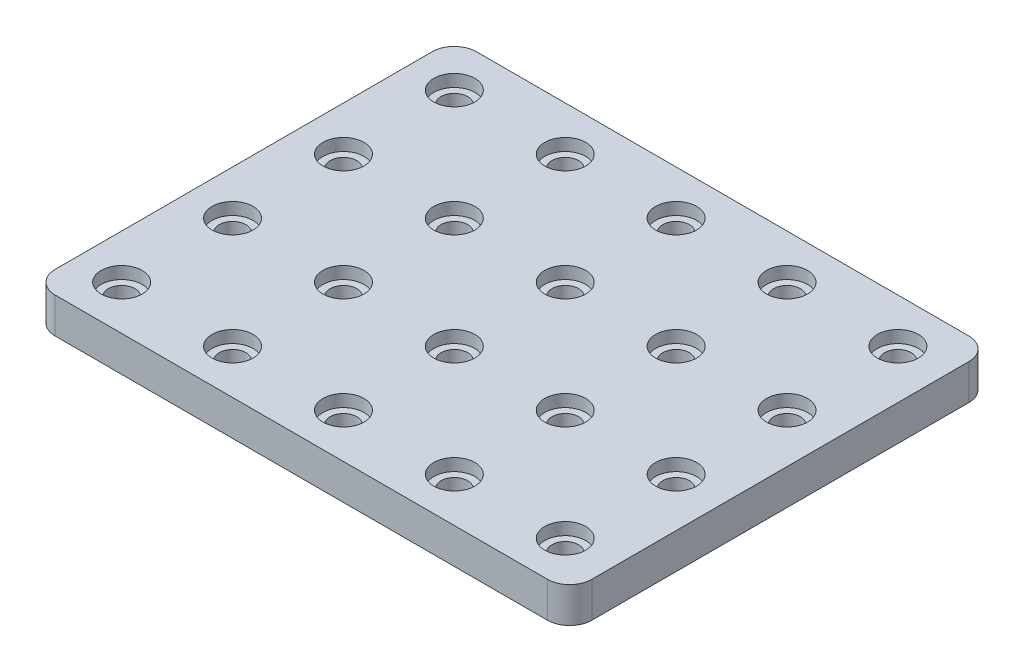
ISO-10303-21;
HEADER;
FILE_DESCRIPTION(('STEP AP214'),'2;1');
FILE_NAME('part.step','',(''),(''),'','','');
FILE_SCHEMA(('AUTOMOTIVE_DESIGN { 1 0 10303 214 1 1 1 1 }'));
ENDSEC;
DATA;
#1=APPLICATION_CONTEXT('core data for automotive mechanical design processes');
#2=APPLICATION_PROTOCOL_DEFINITION('international standard','automotive_design',2000,#1);
#3=PRODUCT_CONTEXT('',#1,'mechanical');
#4=PRODUCT('Part','Part','',(#3));
#5=PRODUCT_RELATED_PRODUCT_CATEGORY('part','',(#4));
#6=PRODUCT_DEFINITION_FORMATION('','',#4);
#7=PRODUCT_DEFINITION_CONTEXT('part definition',#1,'design');
#8=PRODUCT_DEFINITION('design','',#6,#7);
#9=PRODUCT_DEFINITION_SHAPE('','',#8);
#10=(LENGTH_UNIT() NAMED_UNIT(*) SI_UNIT(.MILLI.,.METRE.));
#11=(NAMED_UNIT(*) PLANE_ANGLE_UNIT() SI_UNIT($,.RADIAN.));
#12=(NAMED_UNIT(*) SI_UNIT($,.STERADIAN.) SOLID_ANGLE_UNIT());
#13=UNCERTAINTY_MEASURE_WITH_UNIT(LENGTH_MEASURE(1.E-05),#10,'distance_accuracy_value','');
#14=(GEOMETRIC_REPRESENTATION_CONTEXT(3) GLOBAL_UNCERTAINTY_ASSIGNED_CONTEXT((#13)) GLOBAL_UNIT_ASSIGNED_CONTEXT((#10,
#11,#12)) REPRESENTATION_CONTEXT('',''));
#15=CARTESIAN_POINT('',(0.,0.,0.));
#16=DIRECTION('',(0.,0.,1.));
#17=DIRECTION('',(1.,0.,0.));
#18=AXIS2_PLACEMENT_3D('',#15,#16,#17);
#19=CARTESIAN_POINT('',(10.,16.,-10.));
#20=DIRECTION('',(0.,-1.,0.));
#21=DIRECTION('',(0.,0.,-1.));
#22=AXIS2_PLACEMENT_3D('',#19,#20,#21);
#23=CYLINDRICAL_SURFACE('',#22,10.);
#24=CARTESIAN_POINT('',(10.,0.,-10.));
#25=DIRECTION('',(0.,1.,0.));
#26=DIRECTION('',(0.,0.,-1.));
#27=AXIS2_PLACEMENT_3D('',#24,#25,#26);
#28=CIRCLE('',#27,10.);
#29=CARTESIAN_POINT('',(0.,0.,-10.));
#30=VERTEX_POINT('',#29);
#31=CARTESIAN_POINT('',(10.,0.,0.));
#32=VERTEX_POINT('',#31);
#33=EDGE_CURVE('E98',#30,#32,#28,.T.);
#34=ORIENTED_EDGE('',*,*,#33,.T.);
#35=DIRECTION('',(0.,-1.,0.));
#36=VECTOR('',#35,1.);
#37=CARTESIAN_POINT('',(10.,16.,0.));
#38=LINE('',#37,#36);
#39=CARTESIAN_POINT('',(10.,16.,0.));
#40=VERTEX_POINT('',#39);
#41=EDGE_CURVE('E106',#40,#32,#38,.T.);
#42=ORIENTED_EDGE('',*,*,#41,.F.);
#43=CARTESIAN_POINT('',(10.,16.,-10.));
#44=DIRECTION('',(0.,1.,0.));
#45=DIRECTION('',(0.,0.,-1.));
#46=AXIS2_PLACEMENT_3D('',#43,#44,#45);
#47=CIRCLE('',#46,10.);
#48=CARTESIAN_POINT('',(0.,16.,-10.));
#49=VERTEX_POINT('',#48);
#50=EDGE_CURVE('E134',#49,#40,#47,.T.);
#51=ORIENTED_EDGE('',*,*,#50,.F.);
#52=DIRECTION('',(0.,-1.,0.));
#53=VECTOR('',#52,1.);
#54=CARTESIAN_POINT('',(0.,16.,-10.));
#55=LINE('',#54,#53);
#56=EDGE_CURVE('E115',#49,#30,#55,.T.);
#57=ORIENTED_EDGE('',*,*,#56,.T.);
#58=EDGE_LOOP('',(#34,#42,#51,#57));
#59=FACE_BOUND('',#58,.T.);
#60=ADVANCED_FACE('F27',(#59),#23,.T.);
#61=CARTESIAN_POINT('',(10.,16.,0.));
#62=DIRECTION('',(0.,0.,-1.));
#63=DIRECTION('',(-1.,0.,0.));
#64=AXIS2_PLACEMENT_3D('',#61,#62,#63);
#65=PLANE('',#64);
#66=DIRECTION('',(1.,0.,0.));
#67=VECTOR('',#66,1.);
#68=CARTESIAN_POINT('',(10.,0.,0.));
#69=LINE('',#68,#67);
#70=CARTESIAN_POINT('',(232.,0.,0.));
#71=VERTEX_POINT('',#70);
#72=EDGE_CURVE('E92',#32,#71,#69,.T.);
#73=ORIENTED_EDGE('',*,*,#72,.T.);
#74=DIRECTION('',(0.,-1.,0.));
#75=VECTOR('',#74,1.);
#76=CARTESIAN_POINT('',(232.,16.,0.));
#77=LINE('',#76,#75);
#78=CARTESIAN_POINT('',(232.,16.,0.));
#79=VERTEX_POINT('',#78);
#80=EDGE_CURVE('E112',#79,#71,#77,.T.);
#81=ORIENTED_EDGE('',*,*,#80,.F.);
#82=DIRECTION('',(1.,0.,0.));
#83=VECTOR('',#82,1.);
#84=CARTESIAN_POINT('',(10.,16.,0.));
#85=LINE('',#84,#83);
#86=EDGE_CURVE('E108',#40,#79,#85,.T.);
#87=ORIENTED_EDGE('',*,*,#86,.F.);
#88=ORIENTED_EDGE('',*,*,#41,.T.);
#89=EDGE_LOOP('',(#73,#81,#87,#88));
#90=FACE_BOUND('',#89,.T.);
#91=ADVANCED_FACE('F107',(#90),#65,.F.);
#92=CARTESIAN_POINT('',(232.,16.,-10.));
#93=DIRECTION('',(0.,-1.,0.));
#94=DIRECTION('',(0.,0.,-1.));
#95=AXIS2_PLACEMENT_3D('',#92,#93,#94);
#96=CYLINDRICAL_SURFACE('',#95,10.);
#97=CARTESIAN_POINT('',(232.,0.,-10.));
#98=DIRECTION('',(0.,1.,0.));
#99=DIRECTION('',(0.,0.,1.));
#100=AXIS2_PLACEMENT_3D('',#97,#98,#99);
#101=CIRCLE('',#100,10.);
#102=CARTESIAN_POINT('',(242.,0.,-10.));
#103=VERTEX_POINT('',#102);
#104=EDGE_CURVE('E100',#71,#103,#101,.T.);
#105=ORIENTED_EDGE('',*,*,#104,.T.);
#106=DIRECTION('',(0.,-1.,0.));
#107=VECTOR('',#106,1.);
#108=CARTESIAN_POINT('',(242.,16.,-10.));
#109=LINE('',#108,#107);
#110=CARTESIAN_POINT('',(242.,16.,-10.));
#111=VERTEX_POINT('',#110);
#112=EDGE_CURVE('E160',#111,#103,#109,.T.);
#113=ORIENTED_EDGE('',*,*,#112,.F.);
#114=CARTESIAN_POINT('',(232.,16.,-10.));
#115=DIRECTION('',(0.,1.,0.));
#116=DIRECTION('',(0.,0.,1.));
#117=AXIS2_PLACEMENT_3D('',#114,#115,#116);
#118=CIRCLE('',#117,10.);
#119=EDGE_CURVE('E137',#79,#111,#118,.T.);
#120=ORIENTED_EDGE('',*,*,#119,.F.);
#121=ORIENTED_EDGE('',*,*,#80,.T.);
#122=EDGE_LOOP('',(#105,#113,#120,#121));
#123=FACE_BOUND('',#122,.T.);
#124=ADVANCED_FACE('F398',(#123),#96,.T.);
#125=CARTESIAN_POINT('',(242.,16.,-10.));
#126=DIRECTION('',(-1.,0.,0.));
#127=DIRECTION('',(0.,0.,1.));
#128=AXIS2_PLACEMENT_3D('',#125,#126,#127);
#129=PLANE('',#128);
#130=DIRECTION('',(0.,0.,-1.));
#131=VECTOR('',#130,1.);
#132=CARTESIAN_POINT('',(242.,0.,-10.));
#133=LINE('',#132,#131);
#134=CARTESIAN_POINT('',(242.,0.,-180.));
#135=VERTEX_POINT('',#134);
#136=EDGE_CURVE('E124',#103,#135,#133,.T.);
#137=ORIENTED_EDGE('',*,*,#136,.T.);
#138=DIRECTION('',(0.,-1.,0.));
#139=VECTOR('',#138,1.);
#140=CARTESIAN_POINT('',(242.,16.,-180.));
#141=LINE('',#140,#139);
#142=CARTESIAN_POINT('',(242.,16.,-180.));
#143=VERTEX_POINT('',#142);
#144=EDGE_CURVE('E157',#143,#135,#141,.T.);
#145=ORIENTED_EDGE('',*,*,#144,.F.);
#146=DIRECTION('',(0.,0.,-1.));
#147=VECTOR('',#146,1.);
#148=CARTESIAN_POINT('',(242.,16.,-10.));
#149=LINE('',#148,#147);
#150=EDGE_CURVE('E139',#111,#143,#149,.T.);
#151=ORIENTED_EDGE('',*,*,#150,.F.);
#152=ORIENTED_EDGE('',*,*,#112,.T.);
#153=EDGE_LOOP('',(#137,#145,#151,#152));
#154=FACE_BOUND('',#153,.T.);
#155=ADVANCED_FACE('F986',(#154),#129,.F.);
#156=CARTESIAN_POINT('',(232.,16.,-180.));
#157=DIRECTION('',(0.,-1.,0.));
#158=DIRECTION('',(0.,0.,-1.));
#159=AXIS2_PLACEMENT_3D('',#156,#157,#158);
#160=CYLINDRICAL_SURFACE('',#159,10.);
#161=CARTESIAN_POINT('',(232.,0.,-180.));
#162=DIRECTION('',(0.,1.,0.));
#163=DIRECTION('',(0.,0.,1.));
#164=AXIS2_PLACEMENT_3D('',#161,#162,#163);
#165=CIRCLE('',#164,10.);
#166=CARTESIAN_POINT('',(232.,0.,-190.));
#167=VERTEX_POINT('',#166);
#168=EDGE_CURVE('E126',#135,#167,#165,.T.);
#169=ORIENTED_EDGE('',*,*,#168,.T.);
#170=DIRECTION('',(0.,-1.,0.));
#171=VECTOR('',#170,1.);
#172=CARTESIAN_POINT('',(232.,16.,-190.));
#173=LINE('',#172,#171);
#174=CARTESIAN_POINT('',(232.,16.,-190.));
#175=VERTEX_POINT('',#174);
#176=EDGE_CURVE('E154',#175,#167,#173,.T.);
#177=ORIENTED_EDGE('',*,*,#176,.F.);
#178=CARTESIAN_POINT('',(232.,16.,-180.));
#179=DIRECTION('',(0.,1.,0.));
#180=DIRECTION('',(0.,0.,1.));
#181=AXIS2_PLACEMENT_3D('',#178,#179,#180);
#182=CIRCLE('',#181,10.);
#183=EDGE_CURVE('E141',#143,#175,#182,.T.);
#184=ORIENTED_EDGE('',*,*,#183,.F.);
#185=ORIENTED_EDGE('',*,*,#144,.T.);
#186=EDGE_LOOP('',(#169,#177,#184,#185));
#187=FACE_BOUND('',#186,.T.);
#188=ADVANCED_FACE('F992',(#187),#160,.T.);
#189=CARTESIAN_POINT('',(10.,16.,-190.));
#190=DIRECTION('',(0.,0.,1.));
#191=DIRECTION('',(1.,0.,0.));
#192=AXIS2_PLACEMENT_3D('',#189,#190,#191);
#193=PLANE('',#192);
#194=DIRECTION('',(-1.,0.,0.));
#195=VECTOR('',#194,1.);
#196=CARTESIAN_POINT('',(10.,0.,-190.));
#197=LINE('',#196,#195);
#198=CARTESIAN_POINT('',(10.,0.,-190.));
#199=VERTEX_POINT('',#198);
#200=EDGE_CURVE('E128',#167,#199,#197,.T.);
#201=ORIENTED_EDGE('',*,*,#200,.T.);
#202=DIRECTION('',(0.,-1.,0.));
#203=VECTOR('',#202,1.);
#204=CARTESIAN_POINT('',(10.,16.,-190.));
#205=LINE('',#204,#203);
#206=CARTESIAN_POINT('',(10.,16.,-190.));
#207=VERTEX_POINT('',#206);
#208=EDGE_CURVE('E151',#207,#199,#205,.T.);
#209=ORIENTED_EDGE('',*,*,#208,.F.);
#210=DIRECTION('',(-1.,0.,0.));
#211=VECTOR('',#210,1.);
#212=CARTESIAN_POINT('',(10.,16.,-190.));
#213=LINE('',#212,#211);
#214=EDGE_CURVE('E143',#175,#207,#213,.T.);
#215=ORIENTED_EDGE('',*,*,#214,.F.);
#216=ORIENTED_EDGE('',*,*,#176,.T.);
#217=EDGE_LOOP('',(#201,#209,#215,#216));
#218=FACE_BOUND('',#217,.T.);
#219=ADVANCED_FACE('F996',(#218),#193,.F.);
#220=CARTESIAN_POINT('',(10.,16.,-180.));
#221=DIRECTION('',(0.,-1.,0.));
#222=DIRECTION('',(0.,0.,-1.));
#223=AXIS2_PLACEMENT_3D('',#220,#221,#222);
#224=CYLINDRICAL_SURFACE('',#223,10.);
#225=CARTESIAN_POINT('',(10.,0.,-180.));
#226=DIRECTION('',(0.,1.,0.));
#227=DIRECTION('',(0.,0.,1.));
#228=AXIS2_PLACEMENT_3D('',#225,#226,#227);
#229=CIRCLE('',#228,10.);
#230=CARTESIAN_POINT('',(0.,0.,-180.));
#231=VERTEX_POINT('',#230);
#232=EDGE_CURVE('E130',#199,#231,#229,.T.);
#233=ORIENTED_EDGE('',*,*,#232,.T.);
#234=DIRECTION('',(0.,-1.,0.));
#235=VECTOR('',#234,1.);
#236=CARTESIAN_POINT('',(0.,16.,-180.));
#237=LINE('',#236,#235);
#238=CARTESIAN_POINT('',(0.,16.,-180.));
#239=VERTEX_POINT('',#238);
#240=EDGE_CURVE('E148',#239,#231,#237,.T.);
#241=ORIENTED_EDGE('',*,*,#240,.F.);
#242=CARTESIAN_POINT('',(10.,16.,-180.));
#243=DIRECTION('',(0.,1.,0.));
#244=DIRECTION('',(0.,0.,1.));
#245=AXIS2_PLACEMENT_3D('',#242,#243,#244);
#246=CIRCLE('',#245,10.);
#247=EDGE_CURVE('E47',#207,#239,#246,.T.);
#248=ORIENTED_EDGE('',*,*,#247,.F.);
#249=ORIENTED_EDGE('',*,*,#208,.T.);
#250=EDGE_LOOP('',(#233,#241,#248,#249));
#251=FACE_BOUND('',#250,.T.);
#252=ADVANCED_FACE('F388',(#251),#224,.T.);
#253=CARTESIAN_POINT('',(0.,16.,-10.));
#254=DIRECTION('',(1.,0.,0.));
#255=DIRECTION('',(0.,0.,-1.));
#256=AXIS2_PLACEMENT_3D('',#253,#254,#255);
#257=PLANE('',#256);
#258=DIRECTION('',(0.,0.,1.));
#259=VECTOR('',#258,1.);
#260=CARTESIAN_POINT('',(0.,0.,-10.));
#261=LINE('',#260,#259);
#262=EDGE_CURVE('E132',#231,#30,#261,.T.);
#263=ORIENTED_EDGE('',*,*,#262,.T.);
#264=ORIENTED_EDGE('',*,*,#56,.F.);
#265=DIRECTION('',(0.,0.,1.));
#266=VECTOR('',#265,1.);
#267=CARTESIAN_POINT('',(0.,16.,-10.));
#268=LINE('',#267,#266);
#269=EDGE_CURVE('E42',#239,#49,#268,.T.);
#270=ORIENTED_EDGE('',*,*,#269,.F.);
#271=ORIENTED_EDGE('',*,*,#240,.T.);
#272=EDGE_LOOP('',(#263,#264,#270,#271));
#273=FACE_BOUND('',#272,.T.);
#274=ADVANCED_FACE('F377',(#273),#257,.F.);
#275=CARTESIAN_POINT('',(10.,16.,-10.));
#276=DIRECTION('',(0.,-1.,0.));
#277=DIRECTION('',(0.,0.,-1.));
#278=AXIS2_PLACEMENT_3D('',#275,#276,#277);
#279=PLANE('',#278);
#280=CARTESIAN_POINT('',(20.,16.,-70.));
#281=DIRECTION('',(0.,1.,0.));
#282=DIRECTION('',(0.,0.,1.));
#283=AXIS2_PLACEMENT_3D('',#280,#281,#282);
#284=CIRCLE('',#283,9.24999999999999);
#285=CARTESIAN_POINT('',(20.,16.,-60.75));
#286=VERTEX_POINT('',#285);
#287=EDGE_CURVE('E914',#286,#286,#284,.T.);
#288=ORIENTED_EDGE('',*,*,#287,.F.);
#289=EDGE_LOOP('',(#288));
#290=FACE_BOUND('',#289,.T.);
#291=CARTESIAN_POINT('',(70.,16.,-70.));
#292=DIRECTION('',(0.,1.,0.));
#293=DIRECTION('',(0.,0.,1.));
#294=AXIS2_PLACEMENT_3D('',#291,#292,#293);
#295=CIRCLE('',#294,9.24999999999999);
#296=CARTESIAN_POINT('',(70.,16.,-60.75));
#297=VERTEX_POINT('',#296);
#298=EDGE_CURVE('E902',#297,#297,#295,.T.);
#299=ORIENTED_EDGE('',*,*,#298,.F.);
#300=EDGE_LOOP('',(#299));
#301=FACE_BOUND('',#300,.T.);
#302=CARTESIAN_POINT('',(20.,16.,-20.));
#303=DIRECTION('',(0.,1.,0.));
#304=DIRECTION('',(0.,0.,1.));
#305=AXIS2_PLACEMENT_3D('',#302,#303,#304);
#306=CIRCLE('',#305,9.24999999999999);
#307=CARTESIAN_POINT('',(20.,16.,-10.75));
#308=VERTEX_POINT('',#307);
#309=EDGE_CURVE('E884',#308,#308,#306,.T.);
#310=ORIENTED_EDGE('',*,*,#309,.F.);
#311=EDGE_LOOP('',(#310));
#312=FACE_BOUND('',#311,.T.);
#313=ORIENTED_EDGE('',*,*,#50,.T.);
#314=ORIENTED_EDGE('',*,*,#86,.T.);
#315=ORIENTED_EDGE('',*,*,#119,.T.);
#316=ORIENTED_EDGE('',*,*,#150,.T.);
#317=ORIENTED_EDGE('',*,*,#183,.T.);
#318=ORIENTED_EDGE('',*,*,#214,.T.);
#319=ORIENTED_EDGE('',*,*,#247,.T.);
#320=ORIENTED_EDGE('',*,*,#269,.T.);
#321=EDGE_LOOP('',(#313,#314,#315,#316,#317,#318,#319,#320));
#322=FACE_BOUND('',#321,.T.);
#323=CARTESIAN_POINT('',(70.,16.,-120.));
#324=DIRECTION('',(0.,1.,0.));
#325=DIRECTION('',(0.,0.,1.));
#326=AXIS2_PLACEMENT_3D('',#323,#324,#325);
#327=CIRCLE('',#326,9.24999999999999);
#328=CARTESIAN_POINT('',(70.,16.,-110.75));
#329=VERTEX_POINT('',#328);
#330=EDGE_CURVE('E111',#329,#329,#327,.T.);
#331=ORIENTED_EDGE('',*,*,#330,.F.);
#332=EDGE_LOOP('',(#331));
#333=FACE_BOUND('',#332,.T.);
#334=CARTESIAN_POINT('',(120.,16.,-70.));
#335=DIRECTION('',(0.,1.,0.));
#336=DIRECTION('',(0.,0.,1.));
#337=AXIS2_PLACEMENT_3D('',#334,#335,#336);
#338=CIRCLE('',#337,9.24999999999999);
#339=CARTESIAN_POINT('',(120.,16.,-60.75));
#340=VERTEX_POINT('',#339);
#341=EDGE_CURVE('E175',#340,#340,#338,.T.);
#342=ORIENTED_EDGE('',*,*,#341,.F.);
#343=EDGE_LOOP('',(#342));
#344=FACE_BOUND('',#343,.T.);
#345=CARTESIAN_POINT('',(120.,16.,-120.));
#346=DIRECTION('',(0.,1.,0.));
#347=DIRECTION('',(0.,0.,1.));
#348=AXIS2_PLACEMENT_3D('',#345,#346,#347);
#349=CIRCLE('',#348,9.24999999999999);
#350=CARTESIAN_POINT('',(120.,16.,-110.75));
#351=VERTEX_POINT('',#350);
#352=EDGE_CURVE('E187',#351,#351,#349,.T.);
#353=ORIENTED_EDGE('',*,*,#352,.F.);
#354=EDGE_LOOP('',(#353));
#355=FACE_BOUND('',#354,.T.);
#356=CARTESIAN_POINT('',(170.,16.,-70.));
#357=DIRECTION('',(0.,1.,0.));
#358=DIRECTION('',(0.,0.,1.));
#359=AXIS2_PLACEMENT_3D('',#356,#357,#358);
#360=CIRCLE('',#359,9.24999999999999);
#361=CARTESIAN_POINT('',(170.,16.,-60.75));
#362=VERTEX_POINT('',#361);
#363=EDGE_CURVE('E199',#362,#362,#360,.T.);
#364=ORIENTED_EDGE('',*,*,#363,.F.);
#365=EDGE_LOOP('',(#364));
#366=FACE_BOUND('',#365,.T.);
#367=CARTESIAN_POINT('',(170.,16.,-120.));
#368=DIRECTION('',(0.,1.,0.));
#369=DIRECTION('',(0.,0.,1.));
#370=AXIS2_PLACEMENT_3D('',#367,#368,#369);
#371=CIRCLE('',#370,9.24999999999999);
#372=CARTESIAN_POINT('',(170.,16.,-110.75));
#373=VERTEX_POINT('',#372);
#374=EDGE_CURVE('E211',#373,#373,#371,.T.);
#375=ORIENTED_EDGE('',*,*,#374,.F.);
#376=EDGE_LOOP('',(#375));
#377=FACE_BOUND('',#376,.T.);
#378=CARTESIAN_POINT('',(20.,16.,-120.));
#379=DIRECTION('',(0.,1.,0.));
#380=DIRECTION('',(0.,0.,1.));
#381=AXIS2_PLACEMENT_3D('',#378,#379,#380);
#382=CIRCLE('',#381,9.24999999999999);
#383=CARTESIAN_POINT('',(20.,16.,-110.75));
#384=VERTEX_POINT('',#383);
#385=EDGE_CURVE('E223',#384,#384,#382,.T.);
#386=ORIENTED_EDGE('',*,*,#385,.F.);
#387=EDGE_LOOP('',(#386));
#388=FACE_BOUND('',#387,.T.);
#389=CARTESIAN_POINT('',(20.,16.,-170.));
#390=DIRECTION('',(0.,1.,0.));
#391=DIRECTION('',(0.,0.,1.));
#392=AXIS2_PLACEMENT_3D('',#389,#390,#391);
#393=CIRCLE('',#392,9.24999999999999);
#394=CARTESIAN_POINT('',(20.,16.,-160.75));
#395=VERTEX_POINT('',#394);
#396=EDGE_CURVE('E235',#395,#395,#393,.T.);
#397=ORIENTED_EDGE('',*,*,#396,.F.);
#398=EDGE_LOOP('',(#397));
#399=FACE_BOUND('',#398,.T.);
#400=CARTESIAN_POINT('',(70.,16.,-20.));
#401=DIRECTION('',(0.,1.,0.));
#402=DIRECTION('',(0.,0.,1.));
#403=AXIS2_PLACEMENT_3D('',#400,#401,#402);
#404=CIRCLE('',#403,9.24999999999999);
#405=CARTESIAN_POINT('',(70.,16.,-10.75));
#406=VERTEX_POINT('',#405);
#407=EDGE_CURVE('E247',#406,#406,#404,.T.);
#408=ORIENTED_EDGE('',*,*,#407,.F.);
#409=EDGE_LOOP('',(#408));
#410=FACE_BOUND('',#409,.T.);
#411=CARTESIAN_POINT('',(70.,16.,-170.));
#412=DIRECTION('',(0.,1.,0.));
#413=DIRECTION('',(0.,0.,1.));
#414=AXIS2_PLACEMENT_3D('',#411,#412,#413);
#415=CIRCLE('',#414,9.24999999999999);
#416=CARTESIAN_POINT('',(70.,16.,-160.75));
#417=VERTEX_POINT('',#416);
#418=EDGE_CURVE('E259',#417,#417,#415,.T.);
#419=ORIENTED_EDGE('',*,*,#418,.F.);
#420=EDGE_LOOP('',(#419));
#421=FACE_BOUND('',#420,.T.);
#422=CARTESIAN_POINT('',(120.,16.,-20.));
#423=DIRECTION('',(0.,1.,0.));
#424=DIRECTION('',(0.,0.,1.));
#425=AXIS2_PLACEMENT_3D('',#422,#423,#424);
#426=CIRCLE('',#425,9.24999999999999);
#427=CARTESIAN_POINT('',(120.,16.,-10.75));
#428=VERTEX_POINT('',#427);
#429=EDGE_CURVE('E271',#428,#428,#426,.T.);
#430=ORIENTED_EDGE('',*,*,#429,.F.);
#431=EDGE_LOOP('',(#430));
#432=FACE_BOUND('',#431,.T.);
#433=CARTESIAN_POINT('',(120.,16.,-170.));
#434=DIRECTION('',(0.,1.,0.));
#435=DIRECTION('',(0.,0.,1.));
#436=AXIS2_PLACEMENT_3D('',#433,#434,#435);
#437=CIRCLE('',#436,9.24999999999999);
#438=CARTESIAN_POINT('',(120.,16.,-160.75));
#439=VERTEX_POINT('',#438);
#440=EDGE_CURVE('E283',#439,#439,#437,.T.);
#441=ORIENTED_EDGE('',*,*,#440,.F.);
#442=EDGE_LOOP('',(#441));
#443=FACE_BOUND('',#442,.T.);
#444=CARTESIAN_POINT('',(170.,16.,-20.));
#445=DIRECTION('',(0.,1.,0.));
#446=DIRECTION('',(0.,0.,1.));
#447=AXIS2_PLACEMENT_3D('',#444,#445,#446);
#448=CIRCLE('',#447,9.24999999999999);
#449=CARTESIAN_POINT('',(170.,16.,-10.75));
#450=VERTEX_POINT('',#449);
#451=EDGE_CURVE('E295',#450,#450,#448,.T.);
#452=ORIENTED_EDGE('',*,*,#451,.F.);
#453=EDGE_LOOP('',(#452));
#454=FACE_BOUND('',#453,.T.);
#455=CARTESIAN_POINT('',(170.,16.,-170.));
#456=DIRECTION('',(0.,1.,0.));
#457=DIRECTION('',(0.,0.,1.));
#458=AXIS2_PLACEMENT_3D('',#455,#456,#457);
#459=CIRCLE('',#458,9.24999999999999);
#460=CARTESIAN_POINT('',(170.,16.,-160.75));
#461=VERTEX_POINT('',#460);
#462=EDGE_CURVE('E307',#461,#461,#459,.T.);
#463=ORIENTED_EDGE('',*,*,#462,.F.);
#464=EDGE_LOOP('',(#463));
#465=FACE_BOUND('',#464,.T.);
#466=CARTESIAN_POINT('',(220.,16.,-20.));
#467=DIRECTION('',(0.,1.,0.));
#468=DIRECTION('',(0.,0.,1.));
#469=AXIS2_PLACEMENT_3D('',#466,#467,#468);
#470=CIRCLE('',#469,9.24999999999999);
#471=CARTESIAN_POINT('',(220.,16.,-10.75));
#472=VERTEX_POINT('',#471);
#473=EDGE_CURVE('E319',#472,#472,#470,.T.);
#474=ORIENTED_EDGE('',*,*,#473,.F.);
#475=EDGE_LOOP('',(#474));
#476=FACE_BOUND('',#475,.T.);
#477=CARTESIAN_POINT('',(220.,16.,-70.));
#478=DIRECTION('',(0.,1.,0.));
#479=DIRECTION('',(0.,0.,1.));
#480=AXIS2_PLACEMENT_3D('',#477,#478,#479);
#481=CIRCLE('',#480,9.24999999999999);
#482=CARTESIAN_POINT('',(220.,16.,-60.75));
#483=VERTEX_POINT('',#482);
#484=EDGE_CURVE('E331',#483,#483,#481,.T.);
#485=ORIENTED_EDGE('',*,*,#484,.F.);
#486=EDGE_LOOP('',(#485));
#487=FACE_BOUND('',#486,.T.);
#488=CARTESIAN_POINT('',(220.,16.,-120.));
#489=DIRECTION('',(0.,1.,0.));
#490=DIRECTION('',(0.,0.,1.));
#491=AXIS2_PLACEMENT_3D('',#488,#489,#490);
#492=CIRCLE('',#491,9.24999999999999);
#493=CARTESIAN_POINT('',(220.,16.,-110.75));
#494=VERTEX_POINT('',#493);
#495=EDGE_CURVE('E343',#494,#494,#492,.T.);
#496=ORIENTED_EDGE('',*,*,#495,.F.);
#497=EDGE_LOOP('',(#496));
#498=FACE_BOUND('',#497,.T.);
#499=CARTESIAN_POINT('',(220.,16.,-170.));
#500=DIRECTION('',(0.,1.,0.));
#501=DIRECTION('',(0.,0.,1.));
#502=AXIS2_PLACEMENT_3D('',#499,#500,#501);
#503=CIRCLE('',#502,9.24999999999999);
#504=CARTESIAN_POINT('',(220.,16.,-160.75));
#505=VERTEX_POINT('',#504);
#506=EDGE_CURVE('E355',#505,#505,#503,.T.);
#507=ORIENTED_EDGE('',*,*,#506,.F.);
#508=EDGE_LOOP('',(#507));
#509=FACE_BOUND('',#508,.T.);
#510=ADVANCED_FACE('F375',(#290,#301,#312,#322,#333,#344,#355,#366,#377,#388,#399,#410,#421,
#432,#443,#454,#465,#476,#487,#498,#509),#279,.F.);
#511=CARTESIAN_POINT('',(10.,0.,-10.));
#512=DIRECTION('',(0.,-1.,0.));
#513=DIRECTION('',(0.,0.,-1.));
#514=AXIS2_PLACEMENT_3D('',#511,#512,#513);
#515=PLANE('',#514);
#516=CARTESIAN_POINT('',(20.,0.,-70.));
#517=DIRECTION('',(0.,1.,0.));
#518=DIRECTION('',(0.,0.,1.));
#519=AXIS2_PLACEMENT_3D('',#516,#517,#518);
#520=CIRCLE('',#519,5.99999999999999);
#521=CARTESIAN_POINT('',(20.,0.,-64.));
#522=VERTEX_POINT('',#521);
#523=EDGE_CURVE('E911',#522,#522,#520,.T.);
#524=ORIENTED_EDGE('',*,*,#523,.T.);
#525=EDGE_LOOP('',(#524));
#526=FACE_BOUND('',#525,.T.);
#527=CARTESIAN_POINT('',(70.,0.,-70.));
#528=DIRECTION('',(0.,1.,0.));
#529=DIRECTION('',(0.,0.,1.));
#530=AXIS2_PLACEMENT_3D('',#527,#528,#529);
#531=CIRCLE('',#530,5.99999999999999);
#532=CARTESIAN_POINT('',(70.,0.,-64.));
#533=VERTEX_POINT('',#532);
#534=EDGE_CURVE('E899',#533,#533,#531,.T.);
#535=ORIENTED_EDGE('',*,*,#534,.T.);
#536=EDGE_LOOP('',(#535));
#537=FACE_BOUND('',#536,.T.);
#538=CARTESIAN_POINT('',(20.,0.,-20.));
#539=DIRECTION('',(0.,1.,0.));
#540=DIRECTION('',(0.,0.,1.));
#541=AXIS2_PLACEMENT_3D('',#538,#539,#540);
#542=CIRCLE('',#541,5.99999999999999);
#543=CARTESIAN_POINT('',(20.,0.,-14.));
#544=VERTEX_POINT('',#543);
#545=EDGE_CURVE('E116',#544,#544,#542,.T.);
#546=ORIENTED_EDGE('',*,*,#545,.T.);
#547=EDGE_LOOP('',(#546));
#548=FACE_BOUND('',#547,.T.);
#549=ORIENTED_EDGE('',*,*,#33,.F.);
#550=ORIENTED_EDGE('',*,*,#262,.F.);
#551=ORIENTED_EDGE('',*,*,#232,.F.);
#552=ORIENTED_EDGE('',*,*,#200,.F.);
#553=ORIENTED_EDGE('',*,*,#168,.F.);
#554=ORIENTED_EDGE('',*,*,#136,.F.);
#555=ORIENTED_EDGE('',*,*,#104,.F.);
#556=ORIENTED_EDGE('',*,*,#72,.F.);
#557=EDGE_LOOP('',(#549,#550,#551,#552,#553,#554,#555,#556));
#558=FACE_BOUND('',#557,.T.);
#559=CARTESIAN_POINT('',(70.,0.,-120.));
#560=DIRECTION('',(0.,1.,0.));
#561=DIRECTION('',(0.,0.,1.));
#562=AXIS2_PLACEMENT_3D('',#559,#560,#561);
#563=CIRCLE('',#562,5.99999999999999);
#564=CARTESIAN_POINT('',(70.,0.,-114.));
#565=VERTEX_POINT('',#564);
#566=EDGE_CURVE('E166',#565,#565,#563,.T.);
#567=ORIENTED_EDGE('',*,*,#566,.T.);
#568=EDGE_LOOP('',(#567));
#569=FACE_BOUND('',#568,.T.);
#570=CARTESIAN_POINT('',(120.,0.,-70.));
#571=DIRECTION('',(0.,1.,0.));
#572=DIRECTION('',(0.,0.,1.));
#573=AXIS2_PLACEMENT_3D('',#570,#571,#572);
#574=CIRCLE('',#573,5.99999999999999);
#575=CARTESIAN_POINT('',(120.,0.,-64.));
#576=VERTEX_POINT('',#575);
#577=EDGE_CURVE('E178',#576,#576,#574,.T.);
#578=ORIENTED_EDGE('',*,*,#577,.T.);
#579=EDGE_LOOP('',(#578));
#580=FACE_BOUND('',#579,.T.);
#581=CARTESIAN_POINT('',(120.,0.,-120.));
#582=DIRECTION('',(0.,1.,0.));
#583=DIRECTION('',(0.,0.,1.));
#584=AXIS2_PLACEMENT_3D('',#581,#582,#583);
#585=CIRCLE('',#584,5.99999999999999);
#586=CARTESIAN_POINT('',(120.,0.,-114.));
#587=VERTEX_POINT('',#586);
#588=EDGE_CURVE('E190',#587,#587,#585,.T.);
#589=ORIENTED_EDGE('',*,*,#588,.T.);
#590=EDGE_LOOP('',(#589));
#591=FACE_BOUND('',#590,.T.);
#592=CARTESIAN_POINT('',(170.,0.,-70.));
#593=DIRECTION('',(0.,1.,0.));
#594=DIRECTION('',(0.,0.,1.));
#595=AXIS2_PLACEMENT_3D('',#592,#593,#594);
#596=CIRCLE('',#595,5.99999999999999);
#597=CARTESIAN_POINT('',(170.,0.,-64.));
#598=VERTEX_POINT('',#597);
#599=EDGE_CURVE('E202',#598,#598,#596,.T.);
#600=ORIENTED_EDGE('',*,*,#599,.T.);
#601=EDGE_LOOP('',(#600));
#602=FACE_BOUND('',#601,.T.);
#603=CARTESIAN_POINT('',(170.,0.,-120.));
#604=DIRECTION('',(0.,1.,0.));
#605=DIRECTION('',(0.,0.,1.));
#606=AXIS2_PLACEMENT_3D('',#603,#604,#605);
#607=CIRCLE('',#606,5.99999999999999);
#608=CARTESIAN_POINT('',(170.,0.,-114.));
#609=VERTEX_POINT('',#608);
#610=EDGE_CURVE('E214',#609,#609,#607,.T.);
#611=ORIENTED_EDGE('',*,*,#610,.T.);
#612=EDGE_LOOP('',(#611));
#613=FACE_BOUND('',#612,.T.);
#614=CARTESIAN_POINT('',(20.,0.,-120.));
#615=DIRECTION('',(0.,1.,0.));
#616=DIRECTION('',(0.,0.,1.));
#617=AXIS2_PLACEMENT_3D('',#614,#615,#616);
#618=CIRCLE('',#617,5.99999999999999);
#619=CARTESIAN_POINT('',(20.,0.,-114.));
#620=VERTEX_POINT('',#619);
#621=EDGE_CURVE('E226',#620,#620,#618,.T.);
#622=ORIENTED_EDGE('',*,*,#621,.T.);
#623=EDGE_LOOP('',(#622));
#624=FACE_BOUND('',#623,.T.);
#625=CARTESIAN_POINT('',(20.,0.,-170.));
#626=DIRECTION('',(0.,1.,0.));
#627=DIRECTION('',(0.,0.,1.));
#628=AXIS2_PLACEMENT_3D('',#625,#626,#627);
#629=CIRCLE('',#628,5.99999999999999);
#630=CARTESIAN_POINT('',(20.,0.,-164.));
#631=VERTEX_POINT('',#630);
#632=EDGE_CURVE('E238',#631,#631,#629,.T.);
#633=ORIENTED_EDGE('',*,*,#632,.T.);
#634=EDGE_LOOP('',(#633));
#635=FACE_BOUND('',#634,.T.);
#636=CARTESIAN_POINT('',(70.,0.,-20.));
#637=DIRECTION('',(0.,1.,0.));
#638=DIRECTION('',(0.,0.,1.));
#639=AXIS2_PLACEMENT_3D('',#636,#637,#638);
#640=CIRCLE('',#639,5.99999999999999);
#641=CARTESIAN_POINT('',(70.,0.,-14.));
#642=VERTEX_POINT('',#641);
#643=EDGE_CURVE('E250',#642,#642,#640,.T.);
#644=ORIENTED_EDGE('',*,*,#643,.T.);
#645=EDGE_LOOP('',(#644));
#646=FACE_BOUND('',#645,.T.);
#647=CARTESIAN_POINT('',(70.,0.,-170.));
#648=DIRECTION('',(0.,1.,0.));
#649=DIRECTION('',(0.,0.,1.));
#650=AXIS2_PLACEMENT_3D('',#647,#648,#649);
#651=CIRCLE('',#650,5.99999999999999);
#652=CARTESIAN_POINT('',(70.,0.,-164.));
#653=VERTEX_POINT('',#652);
#654=EDGE_CURVE('E262',#653,#653,#651,.T.);
#655=ORIENTED_EDGE('',*,*,#654,.T.);
#656=EDGE_LOOP('',(#655));
#657=FACE_BOUND('',#656,.T.);
#658=CARTESIAN_POINT('',(120.,0.,-20.));
#659=DIRECTION('',(0.,1.,0.));
#660=DIRECTION('',(0.,0.,1.));
#661=AXIS2_PLACEMENT_3D('',#658,#659,#660);
#662=CIRCLE('',#661,5.99999999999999);
#663=CARTESIAN_POINT('',(120.,0.,-14.));
#664=VERTEX_POINT('',#663);
#665=EDGE_CURVE('E274',#664,#664,#662,.T.);
#666=ORIENTED_EDGE('',*,*,#665,.T.);
#667=EDGE_LOOP('',(#666));
#668=FACE_BOUND('',#667,.T.);
#669=CARTESIAN_POINT('',(120.,0.,-170.));
#670=DIRECTION('',(0.,1.,0.));
#671=DIRECTION('',(0.,0.,1.));
#672=AXIS2_PLACEMENT_3D('',#669,#670,#671);
#673=CIRCLE('',#672,5.99999999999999);
#674=CARTESIAN_POINT('',(120.,0.,-164.));
#675=VERTEX_POINT('',#674);
#676=EDGE_CURVE('E286',#675,#675,#673,.T.);
#677=ORIENTED_EDGE('',*,*,#676,.T.);
#678=EDGE_LOOP('',(#677));
#679=FACE_BOUND('',#678,.T.);
#680=CARTESIAN_POINT('',(170.,0.,-20.));
#681=DIRECTION('',(0.,1.,0.));
#682=DIRECTION('',(0.,0.,1.));
#683=AXIS2_PLACEMENT_3D('',#680,#681,#682);
#684=CIRCLE('',#683,5.99999999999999);
#685=CARTESIAN_POINT('',(170.,0.,-14.));
#686=VERTEX_POINT('',#685);
#687=EDGE_CURVE('E298',#686,#686,#684,.T.);
#688=ORIENTED_EDGE('',*,*,#687,.T.);
#689=EDGE_LOOP('',(#688));
#690=FACE_BOUND('',#689,.T.);
#691=CARTESIAN_POINT('',(170.,0.,-170.));
#692=DIRECTION('',(0.,1.,0.));
#693=DIRECTION('',(0.,0.,1.));
#694=AXIS2_PLACEMENT_3D('',#691,#692,#693);
#695=CIRCLE('',#694,5.99999999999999);
#696=CARTESIAN_POINT('',(170.,0.,-164.));
#697=VERTEX_POINT('',#696);
#698=EDGE_CURVE('E310',#697,#697,#695,.T.);
#699=ORIENTED_EDGE('',*,*,#698,.T.);
#700=EDGE_LOOP('',(#699));
#701=FACE_BOUND('',#700,.T.);
#702=CARTESIAN_POINT('',(220.,0.,-20.));
#703=DIRECTION('',(0.,1.,0.));
#704=DIRECTION('',(0.,0.,1.));
#705=AXIS2_PLACEMENT_3D('',#702,#703,#704);
#706=CIRCLE('',#705,5.99999999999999);
#707=CARTESIAN_POINT('',(220.,0.,-14.));
#708=VERTEX_POINT('',#707);
#709=EDGE_CURVE('E322',#708,#708,#706,.T.);
#710=ORIENTED_EDGE('',*,*,#709,.T.);
#711=EDGE_LOOP('',(#710));
#712=FACE_BOUND('',#711,.T.);
#713=CARTESIAN_POINT('',(220.,0.,-70.));
#714=DIRECTION('',(0.,1.,0.));
#715=DIRECTION('',(0.,0.,1.));
#716=AXIS2_PLACEMENT_3D('',#713,#714,#715);
#717=CIRCLE('',#716,5.99999999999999);
#718=CARTESIAN_POINT('',(220.,0.,-64.));
#719=VERTEX_POINT('',#718);
#720=EDGE_CURVE('E334',#719,#719,#717,.T.);
#721=ORIENTED_EDGE('',*,*,#720,.T.);
#722=EDGE_LOOP('',(#721));
#723=FACE_BOUND('',#722,.T.);
#724=CARTESIAN_POINT('',(220.,0.,-120.));
#725=DIRECTION('',(0.,1.,0.));
#726=DIRECTION('',(0.,0.,1.));
#727=AXIS2_PLACEMENT_3D('',#724,#725,#726);
#728=CIRCLE('',#727,5.99999999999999);
#729=CARTESIAN_POINT('',(220.,0.,-114.));
#730=VERTEX_POINT('',#729);
#731=EDGE_CURVE('E346',#730,#730,#728,.T.);
#732=ORIENTED_EDGE('',*,*,#731,.T.);
#733=EDGE_LOOP('',(#732));
#734=FACE_BOUND('',#733,.T.);
#735=CARTESIAN_POINT('',(220.,0.,-170.));
#736=DIRECTION('',(0.,1.,0.));
#737=DIRECTION('',(0.,0.,1.));
#738=AXIS2_PLACEMENT_3D('',#735,#736,#737);
#739=CIRCLE('',#738,5.99999999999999);
#740=CARTESIAN_POINT('',(220.,0.,-164.));
#741=VERTEX_POINT('',#740);
#742=EDGE_CURVE('E358',#741,#741,#739,.T.);
#743=ORIENTED_EDGE('',*,*,#742,.T.);
#744=EDGE_LOOP('',(#743));
#745=FACE_BOUND('',#744,.T.);
#746=ADVANCED_FACE('F94',(#526,#537,#548,#558,#569,#580,#591,#602,#613,#624,#635,#646,#657,#668,
#679,#690,#701,#712,#723,#734,#745),#515,.T.);
#747=CARTESIAN_POINT('',(20.,16.,-20.));
#748=DIRECTION('',(0.,1.,0.));
#749=DIRECTION('',(0.,0.,1.));
#750=AXIS2_PLACEMENT_3D('',#747,#748,#749);
#751=CYLINDRICAL_SURFACE('',#750,6.);
#752=ORIENTED_EDGE('',*,*,#545,.F.);
#753=EDGE_LOOP('',(#752));
#754=FACE_BOUND('',#753,.T.);
#755=CARTESIAN_POINT('',(20.,10.5,-20.));
#756=DIRECTION('',(0.,1.,0.));
#757=DIRECTION('',(0.,0.,1.));
#758=AXIS2_PLACEMENT_3D('',#755,#756,#757);
#759=CIRCLE('',#758,6.00000000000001);
#760=CARTESIAN_POINT('',(20.,10.5,-14.));
#761=VERTEX_POINT('',#760);
#762=EDGE_CURVE('E119',#761,#761,#759,.T.);
#763=ORIENTED_EDGE('',*,*,#762,.T.);
#764=EDGE_LOOP('',(#763));
#765=FACE_BOUND('',#764,.T.);
#766=ADVANCED_FACE('F384',(#754,#765),#751,.F.);
#767=CARTESIAN_POINT('',(26.,10.5,-20.));
#768=DIRECTION('',(0.,-1.,0.));
#769=DIRECTION('',(0.,0.,-1.));
#770=AXIS2_PLACEMENT_3D('',#767,#768,#769);
#771=PLANE('',#770);
#772=ORIENTED_EDGE('',*,*,#762,.F.);
#773=EDGE_LOOP('',(#772));
#774=FACE_BOUND('',#773,.T.);
#775=CARTESIAN_POINT('',(20.,10.5,-20.));
#776=DIRECTION('',(0.,1.,0.));
#777=DIRECTION('',(0.,0.,1.));
#778=AXIS2_PLACEMENT_3D('',#775,#776,#777);
#779=CIRCLE('',#778,9.24999999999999);
#780=CARTESIAN_POINT('',(20.,10.5,-10.75));
#781=VERTEX_POINT('',#780);
#782=EDGE_CURVE('E881',#781,#781,#779,.T.);
#783=ORIENTED_EDGE('',*,*,#782,.T.);
#784=EDGE_LOOP('',(#783));
#785=FACE_BOUND('',#784,.T.);
#786=ADVANCED_FACE('F863',(#774,#785),#771,.F.);
#787=CARTESIAN_POINT('',(20.,16.,-20.));
#788=DIRECTION('',(0.,1.,0.));
#789=DIRECTION('',(0.,0.,1.));
#790=AXIS2_PLACEMENT_3D('',#787,#788,#789);
#791=CYLINDRICAL_SURFACE('',#790,9.24999999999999);
#792=ORIENTED_EDGE('',*,*,#782,.F.);
#793=EDGE_LOOP('',(#792));
#794=FACE_BOUND('',#793,.T.);
#795=ORIENTED_EDGE('',*,*,#309,.T.);
#796=EDGE_LOOP('',(#795));
#797=FACE_BOUND('',#796,.T.);
#798=ADVANCED_FACE('F834',(#794,#797),#791,.F.);
#799=CARTESIAN_POINT('',(70.,16.,-70.));
#800=DIRECTION('',(0.,1.,0.));
#801=DIRECTION('',(0.,0.,1.));
#802=AXIS2_PLACEMENT_3D('',#799,#800,#801);
#803=CYLINDRICAL_SURFACE('',#802,6.);
#804=ORIENTED_EDGE('',*,*,#534,.F.);
#805=EDGE_LOOP('',(#804));
#806=FACE_BOUND('',#805,.T.);
#807=CARTESIAN_POINT('',(70.,10.5,-70.));
#808=DIRECTION('',(0.,1.,0.));
#809=DIRECTION('',(0.,0.,1.));
#810=AXIS2_PLACEMENT_3D('',#807,#808,#809);
#811=CIRCLE('',#810,6.00000000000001);
#812=CARTESIAN_POINT('',(70.,10.5,-64.));
#813=VERTEX_POINT('',#812);
#814=EDGE_CURVE('E886',#813,#813,#811,.T.);
#815=ORIENTED_EDGE('',*,*,#814,.T.);
#816=EDGE_LOOP('',(#815));
#817=FACE_BOUND('',#816,.T.);
#818=ADVANCED_FACE('F416',(#806,#817),#803,.F.);
#819=CARTESIAN_POINT('',(76.,10.5,-70.));
#820=DIRECTION('',(0.,-1.,0.));
#821=DIRECTION('',(0.,0.,-1.));
#822=AXIS2_PLACEMENT_3D('',#819,#820,#821);
#823=PLANE('',#822);
#824=ORIENTED_EDGE('',*,*,#814,.F.);
#825=EDGE_LOOP('',(#824));
#826=FACE_BOUND('',#825,.T.);
#827=CARTESIAN_POINT('',(70.,10.5,-70.));
#828=DIRECTION('',(0.,1.,0.));
#829=DIRECTION('',(0.,0.,1.));
#830=AXIS2_PLACEMENT_3D('',#827,#828,#829);
#831=CIRCLE('',#830,9.24999999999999);
#832=CARTESIAN_POINT('',(70.,10.5,-60.75));
#833=VERTEX_POINT('',#832);
#834=EDGE_CURVE('E890',#833,#833,#831,.T.);
#835=ORIENTED_EDGE('',*,*,#834,.T.);
#836=EDGE_LOOP('',(#835));
#837=FACE_BOUND('',#836,.T.);
#838=ADVANCED_FACE('F831',(#826,#837),#823,.F.);
#839=CARTESIAN_POINT('',(70.,16.,-70.));
#840=DIRECTION('',(0.,1.,0.));
#841=DIRECTION('',(0.,0.,1.));
#842=AXIS2_PLACEMENT_3D('',#839,#840,#841);
#843=CYLINDRICAL_SURFACE('',#842,9.24999999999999);
#844=ORIENTED_EDGE('',*,*,#834,.F.);
#845=EDGE_LOOP('',(#844));
#846=FACE_BOUND('',#845,.T.);
#847=ORIENTED_EDGE('',*,*,#298,.T.);
#848=EDGE_LOOP('',(#847));
#849=FACE_BOUND('',#848,.T.);
#850=ADVANCED_FACE('F414',(#846,#849),#843,.F.);
#851=CARTESIAN_POINT('',(70.,16.,-120.));
#852=DIRECTION('',(0.,1.,0.));
#853=DIRECTION('',(0.,0.,1.));
#854=AXIS2_PLACEMENT_3D('',#851,#852,#853);
#855=CYLINDRICAL_SURFACE('',#854,9.24999999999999);
#856=CARTESIAN_POINT('',(70.,10.5,-120.));
#857=DIRECTION('',(0.,1.,0.));
#858=DIRECTION('',(0.,0.,1.));
#859=AXIS2_PLACEMENT_3D('',#856,#857,#858);
#860=CIRCLE('',#859,9.24999999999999);
#861=CARTESIAN_POINT('',(70.,10.5,-110.75));
#862=VERTEX_POINT('',#861);
#863=EDGE_CURVE('E172',#862,#862,#860,.T.);
#864=ORIENTED_EDGE('',*,*,#863,.F.);
#865=EDGE_LOOP('',(#864));
#866=FACE_BOUND('',#865,.T.);
#867=ORIENTED_EDGE('',*,*,#330,.T.);
#868=EDGE_LOOP('',(#867));
#869=FACE_BOUND('',#868,.T.);
#870=ADVANCED_FACE('F410',(#866,#869),#855,.F.);
#871=CARTESIAN_POINT('',(76.,10.5,-120.));
#872=DIRECTION('',(0.,-1.,0.));
#873=DIRECTION('',(0.,0.,-1.));
#874=AXIS2_PLACEMENT_3D('',#871,#872,#873);
#875=PLANE('',#874);
#876=CARTESIAN_POINT('',(70.,10.5,-120.));
#877=DIRECTION('',(0.,1.,0.));
#878=DIRECTION('',(0.,0.,1.));
#879=AXIS2_PLACEMENT_3D('',#876,#877,#878);
#880=CIRCLE('',#879,6.00000000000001);
#881=CARTESIAN_POINT('',(70.,10.5,-114.));
#882=VERTEX_POINT('',#881);
#883=EDGE_CURVE('E169',#882,#882,#880,.T.);
#884=ORIENTED_EDGE('',*,*,#883,.F.);
#885=EDGE_LOOP('',(#884));
#886=FACE_BOUND('',#885,.T.);
#887=ORIENTED_EDGE('',*,*,#863,.T.);
#888=EDGE_LOOP('',(#887));
#889=FACE_BOUND('',#888,.T.);
#890=ADVANCED_FACE('F406',(#886,#889),#875,.F.);
#891=CARTESIAN_POINT('',(70.,16.,-120.));
#892=DIRECTION('',(0.,1.,0.));
#893=DIRECTION('',(0.,0.,1.));
#894=AXIS2_PLACEMENT_3D('',#891,#892,#893);
#895=CYLINDRICAL_SURFACE('',#894,6.);
#896=ORIENTED_EDGE('',*,*,#566,.F.);
#897=EDGE_LOOP('',(#896));
#898=FACE_BOUND('',#897,.T.);
#899=ORIENTED_EDGE('',*,*,#883,.T.);
#900=EDGE_LOOP('',(#899));
#901=FACE_BOUND('',#900,.T.);
#902=ADVANCED_FACE('F402',(#898,#901),#895,.F.);
#903=CARTESIAN_POINT('',(120.,16.,-70.));
#904=DIRECTION('',(0.,1.,0.));
#905=DIRECTION('',(0.,0.,1.));
#906=AXIS2_PLACEMENT_3D('',#903,#904,#905);
#907=CYLINDRICAL_SURFACE('',#906,9.24999999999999);
#908=CARTESIAN_POINT('',(120.,10.5,-70.));
#909=DIRECTION('',(0.,1.,0.));
#910=DIRECTION('',(0.,0.,1.));
#911=AXIS2_PLACEMENT_3D('',#908,#909,#910);
#912=CIRCLE('',#911,9.24999999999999);
#913=CARTESIAN_POINT('',(120.,10.5,-60.75));
#914=VERTEX_POINT('',#913);
#915=EDGE_CURVE('E184',#914,#914,#912,.T.);
#916=ORIENTED_EDGE('',*,*,#915,.F.);
#917=EDGE_LOOP('',(#916));
#918=FACE_BOUND('',#917,.T.);
#919=ORIENTED_EDGE('',*,*,#341,.T.);
#920=EDGE_LOOP('',(#919));
#921=FACE_BOUND('',#920,.T.);
#922=ADVANCED_FACE('F405',(#918,#921),#907,.F.);
#923=CARTESIAN_POINT('',(126.,10.5,-70.));
#924=DIRECTION('',(0.,-1.,0.));
#925=DIRECTION('',(0.,0.,-1.));
#926=AXIS2_PLACEMENT_3D('',#923,#924,#925);
#927=PLANE('',#926);
#928=CARTESIAN_POINT('',(120.,10.5,-70.));
#929=DIRECTION('',(0.,1.,0.));
#930=DIRECTION('',(0.,0.,1.));
#931=AXIS2_PLACEMENT_3D('',#928,#929,#930);
#932=CIRCLE('',#931,6.00000000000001);
#933=CARTESIAN_POINT('',(120.,10.5,-64.));
#934=VERTEX_POINT('',#933);
#935=EDGE_CURVE('E181',#934,#934,#932,.T.);
#936=ORIENTED_EDGE('',*,*,#935,.F.);
#937=EDGE_LOOP('',(#936));
#938=FACE_BOUND('',#937,.T.);
#939=ORIENTED_EDGE('',*,*,#915,.T.);
#940=EDGE_LOOP('',(#939));
#941=FACE_BOUND('',#940,.T.);
#942=ADVANCED_FACE('F421',(#938,#941),#927,.F.);
#943=CARTESIAN_POINT('',(120.,16.,-70.));
#944=DIRECTION('',(0.,1.,0.));
#945=DIRECTION('',(0.,0.,1.));
#946=AXIS2_PLACEMENT_3D('',#943,#944,#945);
#947=CYLINDRICAL_SURFACE('',#946,6.);
#948=ORIENTED_EDGE('',*,*,#577,.F.);
#949=EDGE_LOOP('',(#948));
#950=FACE_BOUND('',#949,.T.);
#951=ORIENTED_EDGE('',*,*,#935,.T.);
#952=EDGE_LOOP('',(#951));
#953=FACE_BOUND('',#952,.T.);
#954=ADVANCED_FACE('F417',(#950,#953),#947,.F.);
#955=CARTESIAN_POINT('',(120.,16.,-120.));
#956=DIRECTION('',(0.,1.,0.));
#957=DIRECTION('',(0.,0.,1.));
#958=AXIS2_PLACEMENT_3D('',#955,#956,#957);
#959=CYLINDRICAL_SURFACE('',#958,9.24999999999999);
#960=CARTESIAN_POINT('',(120.,10.5,-120.));
#961=DIRECTION('',(0.,1.,0.));
#962=DIRECTION('',(0.,0.,1.));
#963=AXIS2_PLACEMENT_3D('',#960,#961,#962);
#964=CIRCLE('',#963,9.24999999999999);
#965=CARTESIAN_POINT('',(120.,10.5,-110.75));
#966=VERTEX_POINT('',#965);
#967=EDGE_CURVE('E196',#966,#966,#964,.T.);
#968=ORIENTED_EDGE('',*,*,#967,.F.);
#969=EDGE_LOOP('',(#968));
#970=FACE_BOUND('',#969,.T.);
#971=ORIENTED_EDGE('',*,*,#352,.T.);
#972=EDGE_LOOP('',(#971));
#973=FACE_BOUND('',#972,.T.);
#974=ADVANCED_FACE('F420',(#970,#973),#959,.F.);
#975=CARTESIAN_POINT('',(126.,10.5,-120.));
#976=DIRECTION('',(0.,-1.,0.));
#977=DIRECTION('',(0.,0.,-1.));
#978=AXIS2_PLACEMENT_3D('',#975,#976,#977);
#979=PLANE('',#978);
#980=CARTESIAN_POINT('',(120.,10.5,-120.));
#981=DIRECTION('',(0.,1.,0.));
#982=DIRECTION('',(0.,0.,1.));
#983=AXIS2_PLACEMENT_3D('',#980,#981,#982);
#984=CIRCLE('',#983,6.00000000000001);
#985=CARTESIAN_POINT('',(120.,10.5,-114.));
#986=VERTEX_POINT('',#985);
#987=EDGE_CURVE('E193',#986,#986,#984,.T.);
#988=ORIENTED_EDGE('',*,*,#987,.F.);
#989=EDGE_LOOP('',(#988));
#990=FACE_BOUND('',#989,.T.);
#991=ORIENTED_EDGE('',*,*,#967,.T.);
#992=EDGE_LOOP('',(#991));
#993=FACE_BOUND('',#992,.T.);
#994=ADVANCED_FACE('F433',(#990,#993),#979,.F.);
#995=CARTESIAN_POINT('',(120.,16.,-120.));
#996=DIRECTION('',(0.,1.,0.));
#997=DIRECTION('',(0.,0.,1.));
#998=AXIS2_PLACEMENT_3D('',#995,#996,#997);
#999=CYLINDRICAL_SURFACE('',#998,6.);
#1000=ORIENTED_EDGE('',*,*,#588,.F.);
#1001=EDGE_LOOP('',(#1000));
#1002=FACE_BOUND('',#1001,.T.);
#1003=ORIENTED_EDGE('',*,*,#987,.T.);
#1004=EDGE_LOOP('',(#1003));
#1005=FACE_BOUND('',#1004,.T.);
#1006=ADVANCED_FACE('F429',(#1002,#1005),#999,.F.);
#1007=CARTESIAN_POINT('',(170.,16.,-70.));
#1008=DIRECTION('',(0.,1.,0.));
#1009=DIRECTION('',(0.,0.,1.));
#1010=AXIS2_PLACEMENT_3D('',#1007,#1008,#1009);
#1011=CYLINDRICAL_SURFACE('',#1010,9.24999999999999);
#1012=CARTESIAN_POINT('',(170.,10.5,-70.));
#1013=DIRECTION('',(0.,1.,0.));
#1014=DIRECTION('',(0.,0.,1.));
#1015=AXIS2_PLACEMENT_3D('',#1012,#1013,#1014);
#1016=CIRCLE('',#1015,9.24999999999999);
#1017=CARTESIAN_POINT('',(170.,10.5,-60.75));
#1018=VERTEX_POINT('',#1017);
#1019=EDGE_CURVE('E208',#1018,#1018,#1016,.T.);
#1020=ORIENTED_EDGE('',*,*,#1019,.F.);
#1021=EDGE_LOOP('',(#1020));
#1022=FACE_BOUND('',#1021,.T.);
#1023=ORIENTED_EDGE('',*,*,#363,.T.);
#1024=EDGE_LOOP('',(#1023));
#1025=FACE_BOUND('',#1024,.T.);
#1026=ADVANCED_FACE('F432',(#1022,#1025),#1011,.F.);
#1027=CARTESIAN_POINT('',(176.,10.5,-70.));
#1028=DIRECTION('',(0.,-1.,0.));
#1029=DIRECTION('',(0.,0.,-1.));
#1030=AXIS2_PLACEMENT_3D('',#1027,#1028,#1029);
#1031=PLANE('',#1030);
#1032=CARTESIAN_POINT('',(170.,10.5,-70.));
#1033=DIRECTION('',(0.,1.,0.));
#1034=DIRECTION('',(0.,0.,1.));
#1035=AXIS2_PLACEMENT_3D('',#1032,#1033,#1034);
#1036=CIRCLE('',#1035,6.00000000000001);
#1037=CARTESIAN_POINT('',(170.,10.5,-64.));
#1038=VERTEX_POINT('',#1037);
#1039=EDGE_CURVE('E205',#1038,#1038,#1036,.T.);
#1040=ORIENTED_EDGE('',*,*,#1039,.F.);
#1041=EDGE_LOOP('',(#1040));
#1042=FACE_BOUND('',#1041,.T.);
#1043=ORIENTED_EDGE('',*,*,#1019,.T.);
#1044=EDGE_LOOP('',(#1043));
#1045=FACE_BOUND('',#1044,.T.);
#1046=ADVANCED_FACE('F445',(#1042,#1045),#1031,.F.);
#1047=CARTESIAN_POINT('',(170.,16.,-70.));
#1048=DIRECTION('',(0.,1.,0.));
#1049=DIRECTION('',(0.,0.,1.));
#1050=AXIS2_PLACEMENT_3D('',#1047,#1048,#1049);
#1051=CYLINDRICAL_SURFACE('',#1050,6.);
#1052=ORIENTED_EDGE('',*,*,#599,.F.);
#1053=EDGE_LOOP('',(#1052));
#1054=FACE_BOUND('',#1053,.T.);
#1055=ORIENTED_EDGE('',*,*,#1039,.T.);
#1056=EDGE_LOOP('',(#1055));
#1057=FACE_BOUND('',#1056,.T.);
#1058=ADVANCED_FACE('F441',(#1054,#1057),#1051,.F.);
#1059=CARTESIAN_POINT('',(170.,16.,-120.));
#1060=DIRECTION('',(0.,1.,0.));
#1061=DIRECTION('',(0.,0.,1.));
#1062=AXIS2_PLACEMENT_3D('',#1059,#1060,#1061);
#1063=CYLINDRICAL_SURFACE('',#1062,9.24999999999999);
#1064=CARTESIAN_POINT('',(170.,10.5,-120.));
#1065=DIRECTION('',(0.,1.,0.));
#1066=DIRECTION('',(0.,0.,1.));
#1067=AXIS2_PLACEMENT_3D('',#1064,#1065,#1066);
#1068=CIRCLE('',#1067,9.24999999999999);
#1069=CARTESIAN_POINT('',(170.,10.5,-110.75));
#1070=VERTEX_POINT('',#1069);
#1071=EDGE_CURVE('E220',#1070,#1070,#1068,.T.);
#1072=ORIENTED_EDGE('',*,*,#1071,.F.);
#1073=EDGE_LOOP('',(#1072));
#1074=FACE_BOUND('',#1073,.T.);
#1075=ORIENTED_EDGE('',*,*,#374,.T.);
#1076=EDGE_LOOP('',(#1075));
#1077=FACE_BOUND('',#1076,.T.);
#1078=ADVANCED_FACE('F444',(#1074,#1077),#1063,.F.);
#1079=CARTESIAN_POINT('',(176.,10.5,-120.));
#1080=DIRECTION('',(0.,-1.,0.));
#1081=DIRECTION('',(0.,0.,-1.));
#1082=AXIS2_PLACEMENT_3D('',#1079,#1080,#1081);
#1083=PLANE('',#1082);
#1084=CARTESIAN_POINT('',(170.,10.5,-120.));
#1085=DIRECTION('',(0.,1.,0.));
#1086=DIRECTION('',(0.,0.,1.));
#1087=AXIS2_PLACEMENT_3D('',#1084,#1085,#1086);
#1088=CIRCLE('',#1087,6.00000000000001);
#1089=CARTESIAN_POINT('',(170.,10.5,-114.));
#1090=VERTEX_POINT('',#1089);
#1091=EDGE_CURVE('E217',#1090,#1090,#1088,.T.);
#1092=ORIENTED_EDGE('',*,*,#1091,.F.);
#1093=EDGE_LOOP('',(#1092));
#1094=FACE_BOUND('',#1093,.T.);
#1095=ORIENTED_EDGE('',*,*,#1071,.T.);
#1096=EDGE_LOOP('',(#1095));
#1097=FACE_BOUND('',#1096,.T.);
#1098=ADVANCED_FACE('F457',(#1094,#1097),#1083,.F.);
#1099=CARTESIAN_POINT('',(170.,16.,-120.));
#1100=DIRECTION('',(0.,1.,0.));
#1101=DIRECTION('',(0.,0.,1.));
#1102=AXIS2_PLACEMENT_3D('',#1099,#1100,#1101);
#1103=CYLINDRICAL_SURFACE('',#1102,6.);
#1104=ORIENTED_EDGE('',*,*,#610,.F.);
#1105=EDGE_LOOP('',(#1104));
#1106=FACE_BOUND('',#1105,.T.);
#1107=ORIENTED_EDGE('',*,*,#1091,.T.);
#1108=EDGE_LOOP('',(#1107));
#1109=FACE_BOUND('',#1108,.T.);
#1110=ADVANCED_FACE('F453',(#1106,#1109),#1103,.F.);
#1111=CARTESIAN_POINT('',(20.,16.,-70.));
#1112=DIRECTION('',(0.,1.,0.));
#1113=DIRECTION('',(0.,0.,1.));
#1114=AXIS2_PLACEMENT_3D('',#1111,#1112,#1113);
#1115=CYLINDRICAL_SURFACE('',#1114,6.);
#1116=ORIENTED_EDGE('',*,*,#523,.F.);
#1117=EDGE_LOOP('',(#1116));
#1118=FACE_BOUND('',#1117,.T.);
#1119=CARTESIAN_POINT('',(20.,10.5,-70.));
#1120=DIRECTION('',(0.,1.,0.));
#1121=DIRECTION('',(0.,0.,1.));
#1122=AXIS2_PLACEMENT_3D('',#1119,#1120,#1121);
#1123=CIRCLE('',#1122,6.00000000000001);
#1124=CARTESIAN_POINT('',(20.,10.5,-64.));
#1125=VERTEX_POINT('',#1124);
#1126=EDGE_CURVE('E905',#1125,#1125,#1123,.T.);
#1127=ORIENTED_EDGE('',*,*,#1126,.T.);
#1128=EDGE_LOOP('',(#1127));
#1129=FACE_BOUND('',#1128,.T.);
#1130=ADVANCED_FACE('F456',(#1118,#1129),#1115,.F.);
#1131=CARTESIAN_POINT('',(26.,10.5,-70.));
#1132=DIRECTION('',(0.,-1.,0.));
#1133=DIRECTION('',(0.,0.,-1.));
#1134=AXIS2_PLACEMENT_3D('',#1131,#1132,#1133);
#1135=PLANE('',#1134);
#1136=ORIENTED_EDGE('',*,*,#1126,.F.);
#1137=EDGE_LOOP('',(#1136));
#1138=FACE_BOUND('',#1137,.T.);
#1139=CARTESIAN_POINT('',(20.,10.5,-70.));
#1140=DIRECTION('',(0.,1.,0.));
#1141=DIRECTION('',(0.,0.,1.));
#1142=AXIS2_PLACEMENT_3D('',#1139,#1140,#1141);
#1143=CIRCLE('',#1142,9.24999999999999);
#1144=CARTESIAN_POINT('',(20.,10.5,-60.75));
#1145=VERTEX_POINT('',#1144);
#1146=EDGE_CURVE('E908',#1145,#1145,#1143,.T.);
#1147=ORIENTED_EDGE('',*,*,#1146,.T.);
#1148=EDGE_LOOP('',(#1147));
#1149=FACE_BOUND('',#1148,.T.);
#1150=ADVANCED_FACE('F749',(#1138,#1149),#1135,.F.);
#1151=CARTESIAN_POINT('',(20.,16.,-70.));
#1152=DIRECTION('',(0.,1.,0.));
#1153=DIRECTION('',(0.,0.,1.));
#1154=AXIS2_PLACEMENT_3D('',#1151,#1152,#1153);
#1155=CYLINDRICAL_SURFACE('',#1154,9.24999999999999);
#1156=ORIENTED_EDGE('',*,*,#1146,.F.);
#1157=EDGE_LOOP('',(#1156));
#1158=FACE_BOUND('',#1157,.T.);
#1159=ORIENTED_EDGE('',*,*,#287,.T.);
#1160=EDGE_LOOP('',(#1159));
#1161=FACE_BOUND('',#1160,.T.);
#1162=ADVANCED_FACE('F459',(#1158,#1161),#1155,.F.);
#1163=CARTESIAN_POINT('',(20.,16.,-120.));
#1164=DIRECTION('',(0.,1.,0.));
#1165=DIRECTION('',(0.,0.,1.));
#1166=AXIS2_PLACEMENT_3D('',#1163,#1164,#1165);
#1167=CYLINDRICAL_SURFACE('',#1166,9.24999999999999);
#1168=CARTESIAN_POINT('',(20.,10.5,-120.));
#1169=DIRECTION('',(0.,1.,0.));
#1170=DIRECTION('',(0.,0.,1.));
#1171=AXIS2_PLACEMENT_3D('',#1168,#1169,#1170);
#1172=CIRCLE('',#1171,9.24999999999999);
#1173=CARTESIAN_POINT('',(20.,10.5,-110.75));
#1174=VERTEX_POINT('',#1173);
#1175=EDGE_CURVE('E232',#1174,#1174,#1172,.T.);
#1176=ORIENTED_EDGE('',*,*,#1175,.F.);
#1177=EDGE_LOOP('',(#1176));
#1178=FACE_BOUND('',#1177,.T.);
#1179=ORIENTED_EDGE('',*,*,#385,.T.);
#1180=EDGE_LOOP('',(#1179));
#1181=FACE_BOUND('',#1180,.T.);
#1182=ADVANCED_FACE('F474',(#1178,#1181),#1167,.F.);
#1183=CARTESIAN_POINT('',(26.,10.5,-120.));
#1184=DIRECTION('',(0.,-1.,0.));
#1185=DIRECTION('',(0.,0.,-1.));
#1186=AXIS2_PLACEMENT_3D('',#1183,#1184,#1185);
#1187=PLANE('',#1186);
#1188=CARTESIAN_POINT('',(20.,10.5,-120.));
#1189=DIRECTION('',(0.,1.,0.));
#1190=DIRECTION('',(0.,0.,1.));
#1191=AXIS2_PLACEMENT_3D('',#1188,#1189,#1190);
#1192=CIRCLE('',#1191,6.00000000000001);
#1193=CARTESIAN_POINT('',(20.,10.5,-114.));
#1194=VERTEX_POINT('',#1193);
#1195=EDGE_CURVE('E229',#1194,#1194,#1192,.T.);
#1196=ORIENTED_EDGE('',*,*,#1195,.F.);
#1197=EDGE_LOOP('',(#1196));
#1198=FACE_BOUND('',#1197,.T.);
#1199=ORIENTED_EDGE('',*,*,#1175,.T.);
#1200=EDGE_LOOP('',(#1199));
#1201=FACE_BOUND('',#1200,.T.);
#1202=ADVANCED_FACE('F470',(#1198,#1201),#1187,.F.);
#1203=CARTESIAN_POINT('',(20.,16.,-120.));
#1204=DIRECTION('',(0.,1.,0.));
#1205=DIRECTION('',(0.,0.,1.));
#1206=AXIS2_PLACEMENT_3D('',#1203,#1204,#1205);
#1207=CYLINDRICAL_SURFACE('',#1206,6.);
#1208=ORIENTED_EDGE('',*,*,#621,.F.);
#1209=EDGE_LOOP('',(#1208));
#1210=FACE_BOUND('',#1209,.T.);
#1211=ORIENTED_EDGE('',*,*,#1195,.T.);
#1212=EDGE_LOOP('',(#1211));
#1213=FACE_BOUND('',#1212,.T.);
#1214=ADVANCED_FACE('F466',(#1210,#1213),#1207,.F.);
#1215=CARTESIAN_POINT('',(20.,16.,-170.));
#1216=DIRECTION('',(0.,1.,0.));
#1217=DIRECTION('',(0.,0.,1.));
#1218=AXIS2_PLACEMENT_3D('',#1215,#1216,#1217);
#1219=CYLINDRICAL_SURFACE('',#1218,9.24999999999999);
#1220=CARTESIAN_POINT('',(20.,10.5,-170.));
#1221=DIRECTION('',(0.,1.,0.));
#1222=DIRECTION('',(0.,0.,1.));
#1223=AXIS2_PLACEMENT_3D('',#1220,#1221,#1222);
#1224=CIRCLE('',#1223,9.24999999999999);
#1225=CARTESIAN_POINT('',(20.,10.5,-160.75));
#1226=VERTEX_POINT('',#1225);
#1227=EDGE_CURVE('E244',#1226,#1226,#1224,.T.);
#1228=ORIENTED_EDGE('',*,*,#1227,.F.);
#1229=EDGE_LOOP('',(#1228));
#1230=FACE_BOUND('',#1229,.T.);
#1231=ORIENTED_EDGE('',*,*,#396,.T.);
#1232=EDGE_LOOP('',(#1231));
#1233=FACE_BOUND('',#1232,.T.);
#1234=ADVANCED_FACE('F469',(#1230,#1233),#1219,.F.);
#1235=CARTESIAN_POINT('',(26.,10.5,-170.));
#1236=DIRECTION('',(0.,-1.,0.));
#1237=DIRECTION('',(0.,0.,-1.));
#1238=AXIS2_PLACEMENT_3D('',#1235,#1236,#1237);
#1239=PLANE('',#1238);
#1240=CARTESIAN_POINT('',(20.,10.5,-170.));
#1241=DIRECTION('',(0.,1.,0.));
#1242=DIRECTION('',(0.,0.,1.));
#1243=AXIS2_PLACEMENT_3D('',#1240,#1241,#1242);
#1244=CIRCLE('',#1243,6.00000000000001);
#1245=CARTESIAN_POINT('',(20.,10.5,-164.));
#1246=VERTEX_POINT('',#1245);
#1247=EDGE_CURVE('E241',#1246,#1246,#1244,.T.);
#1248=ORIENTED_EDGE('',*,*,#1247,.F.);
#1249=EDGE_LOOP('',(#1248));
#1250=FACE_BOUND('',#1249,.T.);
#1251=ORIENTED_EDGE('',*,*,#1227,.T.);
#1252=EDGE_LOOP('',(#1251));
#1253=FACE_BOUND('',#1252,.T.);
#1254=ADVANCED_FACE('F483',(#1250,#1253),#1239,.F.);
#1255=CARTESIAN_POINT('',(20.,16.,-170.));
#1256=DIRECTION('',(0.,1.,0.));
#1257=DIRECTION('',(0.,0.,1.));
#1258=AXIS2_PLACEMENT_3D('',#1255,#1256,#1257);
#1259=CYLINDRICAL_SURFACE('',#1258,6.);
#1260=ORIENTED_EDGE('',*,*,#632,.F.);
#1261=EDGE_LOOP('',(#1260));
#1262=FACE_BOUND('',#1261,.T.);
#1263=ORIENTED_EDGE('',*,*,#1247,.T.);
#1264=EDGE_LOOP('',(#1263));
#1265=FACE_BOUND('',#1264,.T.);
#1266=ADVANCED_FACE('F479',(#1262,#1265),#1259,.F.);
#1267=CARTESIAN_POINT('',(70.,16.,-20.));
#1268=DIRECTION('',(0.,1.,0.));
#1269=DIRECTION('',(0.,0.,1.));
#1270=AXIS2_PLACEMENT_3D('',#1267,#1268,#1269);
#1271=CYLINDRICAL_SURFACE('',#1270,9.24999999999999);
#1272=CARTESIAN_POINT('',(70.,10.5,-20.));
#1273=DIRECTION('',(0.,1.,0.));
#1274=DIRECTION('',(0.,0.,1.));
#1275=AXIS2_PLACEMENT_3D('',#1272,#1273,#1274);
#1276=CIRCLE('',#1275,9.24999999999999);
#1277=CARTESIAN_POINT('',(70.,10.5,-10.75));
#1278=VERTEX_POINT('',#1277);
#1279=EDGE_CURVE('E256',#1278,#1278,#1276,.T.);
#1280=ORIENTED_EDGE('',*,*,#1279,.F.);
#1281=EDGE_LOOP('',(#1280));
#1282=FACE_BOUND('',#1281,.T.);
#1283=ORIENTED_EDGE('',*,*,#407,.T.);
#1284=EDGE_LOOP('',(#1283));
#1285=FACE_BOUND('',#1284,.T.);
#1286=ADVANCED_FACE('F482',(#1282,#1285),#1271,.F.);
#1287=CARTESIAN_POINT('',(76.,10.5,-20.));
#1288=DIRECTION('',(0.,-1.,0.));
#1289=DIRECTION('',(0.,0.,-1.));
#1290=AXIS2_PLACEMENT_3D('',#1287,#1288,#1289);
#1291=PLANE('',#1290);
#1292=CARTESIAN_POINT('',(70.,10.5,-20.));
#1293=DIRECTION('',(0.,1.,0.));
#1294=DIRECTION('',(0.,0.,1.));
#1295=AXIS2_PLACEMENT_3D('',#1292,#1293,#1294);
#1296=CIRCLE('',#1295,6.00000000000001);
#1297=CARTESIAN_POINT('',(70.,10.5,-14.));
#1298=VERTEX_POINT('',#1297);
#1299=EDGE_CURVE('E253',#1298,#1298,#1296,.T.);
#1300=ORIENTED_EDGE('',*,*,#1299,.F.);
#1301=EDGE_LOOP('',(#1300));
#1302=FACE_BOUND('',#1301,.T.);
#1303=ORIENTED_EDGE('',*,*,#1279,.T.);
#1304=EDGE_LOOP('',(#1303));
#1305=FACE_BOUND('',#1304,.T.);
#1306=ADVANCED_FACE('F495',(#1302,#1305),#1291,.F.);
#1307=CARTESIAN_POINT('',(70.,16.,-20.));
#1308=DIRECTION('',(0.,1.,0.));
#1309=DIRECTION('',(0.,0.,1.));
#1310=AXIS2_PLACEMENT_3D('',#1307,#1308,#1309);
#1311=CYLINDRICAL_SURFACE('',#1310,6.);
#1312=ORIENTED_EDGE('',*,*,#643,.F.);
#1313=EDGE_LOOP('',(#1312));
#1314=FACE_BOUND('',#1313,.T.);
#1315=ORIENTED_EDGE('',*,*,#1299,.T.);
#1316=EDGE_LOOP('',(#1315));
#1317=FACE_BOUND('',#1316,.T.);
#1318=ADVANCED_FACE('F491',(#1314,#1317),#1311,.F.);
#1319=CARTESIAN_POINT('',(70.,16.,-170.));
#1320=DIRECTION('',(0.,1.,0.));
#1321=DIRECTION('',(0.,0.,1.));
#1322=AXIS2_PLACEMENT_3D('',#1319,#1320,#1321);
#1323=CYLINDRICAL_SURFACE('',#1322,9.24999999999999);
#1324=CARTESIAN_POINT('',(70.,10.5,-170.));
#1325=DIRECTION('',(0.,1.,0.));
#1326=DIRECTION('',(0.,0.,1.));
#1327=AXIS2_PLACEMENT_3D('',#1324,#1325,#1326);
#1328=CIRCLE('',#1327,9.24999999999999);
#1329=CARTESIAN_POINT('',(70.,10.5,-160.75));
#1330=VERTEX_POINT('',#1329);
#1331=EDGE_CURVE('E268',#1330,#1330,#1328,.T.);
#1332=ORIENTED_EDGE('',*,*,#1331,.F.);
#1333=EDGE_LOOP('',(#1332));
#1334=FACE_BOUND('',#1333,.T.);
#1335=ORIENTED_EDGE('',*,*,#418,.T.);
#1336=EDGE_LOOP('',(#1335));
#1337=FACE_BOUND('',#1336,.T.);
#1338=ADVANCED_FACE('F494',(#1334,#1337),#1323,.F.);
#1339=CARTESIAN_POINT('',(76.,10.5,-170.));
#1340=DIRECTION('',(0.,-1.,0.));
#1341=DIRECTION('',(0.,0.,-1.));
#1342=AXIS2_PLACEMENT_3D('',#1339,#1340,#1341);
#1343=PLANE('',#1342);
#1344=CARTESIAN_POINT('',(70.,10.5,-170.));
#1345=DIRECTION('',(0.,1.,0.));
#1346=DIRECTION('',(0.,0.,1.));
#1347=AXIS2_PLACEMENT_3D('',#1344,#1345,#1346);
#1348=CIRCLE('',#1347,6.00000000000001);
#1349=CARTESIAN_POINT('',(70.,10.5,-164.));
#1350=VERTEX_POINT('',#1349);
#1351=EDGE_CURVE('E265',#1350,#1350,#1348,.T.);
#1352=ORIENTED_EDGE('',*,*,#1351,.F.);
#1353=EDGE_LOOP('',(#1352));
#1354=FACE_BOUND('',#1353,.T.);
#1355=ORIENTED_EDGE('',*,*,#1331,.T.);
#1356=EDGE_LOOP('',(#1355));
#1357=FACE_BOUND('',#1356,.T.);
#1358=ADVANCED_FACE('F507',(#1354,#1357),#1343,.F.);
#1359=CARTESIAN_POINT('',(70.,16.,-170.));
#1360=DIRECTION('',(0.,1.,0.));
#1361=DIRECTION('',(0.,0.,1.));
#1362=AXIS2_PLACEMENT_3D('',#1359,#1360,#1361);
#1363=CYLINDRICAL_SURFACE('',#1362,6.);
#1364=ORIENTED_EDGE('',*,*,#654,.F.);
#1365=EDGE_LOOP('',(#1364));
#1366=FACE_BOUND('',#1365,.T.);
#1367=ORIENTED_EDGE('',*,*,#1351,.T.);
#1368=EDGE_LOOP('',(#1367));
#1369=FACE_BOUND('',#1368,.T.);
#1370=ADVANCED_FACE('F503',(#1366,#1369),#1363,.F.);
#1371=CARTESIAN_POINT('',(120.,16.,-20.));
#1372=DIRECTION('',(0.,1.,0.));
#1373=DIRECTION('',(0.,0.,1.));
#1374=AXIS2_PLACEMENT_3D('',#1371,#1372,#1373);
#1375=CYLINDRICAL_SURFACE('',#1374,9.24999999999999);
#1376=CARTESIAN_POINT('',(120.,10.5,-20.));
#1377=DIRECTION('',(0.,1.,0.));
#1378=DIRECTION('',(0.,0.,1.));
#1379=AXIS2_PLACEMENT_3D('',#1376,#1377,#1378);
#1380=CIRCLE('',#1379,9.24999999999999);
#1381=CARTESIAN_POINT('',(120.,10.5,-10.75));
#1382=VERTEX_POINT('',#1381);
#1383=EDGE_CURVE('E280',#1382,#1382,#1380,.T.);
#1384=ORIENTED_EDGE('',*,*,#1383,.F.);
#1385=EDGE_LOOP('',(#1384));
#1386=FACE_BOUND('',#1385,.T.);
#1387=ORIENTED_EDGE('',*,*,#429,.T.);
#1388=EDGE_LOOP('',(#1387));
#1389=FACE_BOUND('',#1388,.T.);
#1390=ADVANCED_FACE('F506',(#1386,#1389),#1375,.F.);
#1391=CARTESIAN_POINT('',(126.,10.5,-20.));
#1392=DIRECTION('',(0.,-1.,0.));
#1393=DIRECTION('',(0.,0.,-1.));
#1394=AXIS2_PLACEMENT_3D('',#1391,#1392,#1393);
#1395=PLANE('',#1394);
#1396=CARTESIAN_POINT('',(120.,10.5,-20.));
#1397=DIRECTION('',(0.,1.,0.));
#1398=DIRECTION('',(0.,0.,1.));
#1399=AXIS2_PLACEMENT_3D('',#1396,#1397,#1398);
#1400=CIRCLE('',#1399,6.00000000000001);
#1401=CARTESIAN_POINT('',(120.,10.5,-14.));
#1402=VERTEX_POINT('',#1401);
#1403=EDGE_CURVE('E277',#1402,#1402,#1400,.T.);
#1404=ORIENTED_EDGE('',*,*,#1403,.F.);
#1405=EDGE_LOOP('',(#1404));
#1406=FACE_BOUND('',#1405,.T.);
#1407=ORIENTED_EDGE('',*,*,#1383,.T.);
#1408=EDGE_LOOP('',(#1407));
#1409=FACE_BOUND('',#1408,.T.);
#1410=ADVANCED_FACE('F519',(#1406,#1409),#1395,.F.);
#1411=CARTESIAN_POINT('',(120.,16.,-20.));
#1412=DIRECTION('',(0.,1.,0.));
#1413=DIRECTION('',(0.,0.,1.));
#1414=AXIS2_PLACEMENT_3D('',#1411,#1412,#1413);
#1415=CYLINDRICAL_SURFACE('',#1414,6.);
#1416=ORIENTED_EDGE('',*,*,#665,.F.);
#1417=EDGE_LOOP('',(#1416));
#1418=FACE_BOUND('',#1417,.T.);
#1419=ORIENTED_EDGE('',*,*,#1403,.T.);
#1420=EDGE_LOOP('',(#1419));
#1421=FACE_BOUND('',#1420,.T.);
#1422=ADVANCED_FACE('F515',(#1418,#1421),#1415,.F.);
#1423=CARTESIAN_POINT('',(120.,16.,-170.));
#1424=DIRECTION('',(0.,1.,0.));
#1425=DIRECTION('',(0.,0.,1.));
#1426=AXIS2_PLACEMENT_3D('',#1423,#1424,#1425);
#1427=CYLINDRICAL_SURFACE('',#1426,9.24999999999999);
#1428=CARTESIAN_POINT('',(120.,10.5,-170.));
#1429=DIRECTION('',(0.,1.,0.));
#1430=DIRECTION('',(0.,0.,1.));
#1431=AXIS2_PLACEMENT_3D('',#1428,#1429,#1430);
#1432=CIRCLE('',#1431,9.24999999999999);
#1433=CARTESIAN_POINT('',(120.,10.5,-160.75));
#1434=VERTEX_POINT('',#1433);
#1435=EDGE_CURVE('E292',#1434,#1434,#1432,.T.);
#1436=ORIENTED_EDGE('',*,*,#1435,.F.);
#1437=EDGE_LOOP('',(#1436));
#1438=FACE_BOUND('',#1437,.T.);
#1439=ORIENTED_EDGE('',*,*,#440,.T.);
#1440=EDGE_LOOP('',(#1439));
#1441=FACE_BOUND('',#1440,.T.);
#1442=ADVANCED_FACE('F518',(#1438,#1441),#1427,.F.);
#1443=CARTESIAN_POINT('',(126.,10.5,-170.));
#1444=DIRECTION('',(0.,-1.,0.));
#1445=DIRECTION('',(0.,0.,-1.));
#1446=AXIS2_PLACEMENT_3D('',#1443,#1444,#1445);
#1447=PLANE('',#1446);
#1448=CARTESIAN_POINT('',(120.,10.5,-170.));
#1449=DIRECTION('',(0.,1.,0.));
#1450=DIRECTION('',(0.,0.,1.));
#1451=AXIS2_PLACEMENT_3D('',#1448,#1449,#1450);
#1452=CIRCLE('',#1451,6.00000000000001);
#1453=CARTESIAN_POINT('',(120.,10.5,-164.));
#1454=VERTEX_POINT('',#1453);
#1455=EDGE_CURVE('E289',#1454,#1454,#1452,.T.);
#1456=ORIENTED_EDGE('',*,*,#1455,.F.);
#1457=EDGE_LOOP('',(#1456));
#1458=FACE_BOUND('',#1457,.T.);
#1459=ORIENTED_EDGE('',*,*,#1435,.T.);
#1460=EDGE_LOOP('',(#1459));
#1461=FACE_BOUND('',#1460,.T.);
#1462=ADVANCED_FACE('F531',(#1458,#1461),#1447,.F.);
#1463=CARTESIAN_POINT('',(120.,16.,-170.));
#1464=DIRECTION('',(0.,1.,0.));
#1465=DIRECTION('',(0.,0.,1.));
#1466=AXIS2_PLACEMENT_3D('',#1463,#1464,#1465);
#1467=CYLINDRICAL_SURFACE('',#1466,6.);
#1468=ORIENTED_EDGE('',*,*,#676,.F.);
#1469=EDGE_LOOP('',(#1468));
#1470=FACE_BOUND('',#1469,.T.);
#1471=ORIENTED_EDGE('',*,*,#1455,.T.);
#1472=EDGE_LOOP('',(#1471));
#1473=FACE_BOUND('',#1472,.T.);
#1474=ADVANCED_FACE('F527',(#1470,#1473),#1467,.F.);
#1475=CARTESIAN_POINT('',(170.,16.,-20.));
#1476=DIRECTION('',(0.,1.,0.));
#1477=DIRECTION('',(0.,0.,1.));
#1478=AXIS2_PLACEMENT_3D('',#1475,#1476,#1477);
#1479=CYLINDRICAL_SURFACE('',#1478,9.24999999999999);
#1480=CARTESIAN_POINT('',(170.,10.5,-20.));
#1481=DIRECTION('',(0.,1.,0.));
#1482=DIRECTION('',(0.,0.,1.));
#1483=AXIS2_PLACEMENT_3D('',#1480,#1481,#1482);
#1484=CIRCLE('',#1483,9.24999999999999);
#1485=CARTESIAN_POINT('',(170.,10.5,-10.75));
#1486=VERTEX_POINT('',#1485);
#1487=EDGE_CURVE('E304',#1486,#1486,#1484,.T.);
#1488=ORIENTED_EDGE('',*,*,#1487,.F.);
#1489=EDGE_LOOP('',(#1488));
#1490=FACE_BOUND('',#1489,.T.);
#1491=ORIENTED_EDGE('',*,*,#451,.T.);
#1492=EDGE_LOOP('',(#1491));
#1493=FACE_BOUND('',#1492,.T.);
#1494=ADVANCED_FACE('F530',(#1490,#1493),#1479,.F.);
#1495=CARTESIAN_POINT('',(176.,10.5,-20.));
#1496=DIRECTION('',(0.,-1.,0.));
#1497=DIRECTION('',(0.,0.,-1.));
#1498=AXIS2_PLACEMENT_3D('',#1495,#1496,#1497);
#1499=PLANE('',#1498);
#1500=CARTESIAN_POINT('',(170.,10.5,-20.));
#1501=DIRECTION('',(0.,1.,0.));
#1502=DIRECTION('',(0.,0.,1.));
#1503=AXIS2_PLACEMENT_3D('',#1500,#1501,#1502);
#1504=CIRCLE('',#1503,6.00000000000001);
#1505=CARTESIAN_POINT('',(170.,10.5,-14.));
#1506=VERTEX_POINT('',#1505);
#1507=EDGE_CURVE('E301',#1506,#1506,#1504,.T.);
#1508=ORIENTED_EDGE('',*,*,#1507,.F.);
#1509=EDGE_LOOP('',(#1508));
#1510=FACE_BOUND('',#1509,.T.);
#1511=ORIENTED_EDGE('',*,*,#1487,.T.);
#1512=EDGE_LOOP('',(#1511));
#1513=FACE_BOUND('',#1512,.T.);
#1514=ADVANCED_FACE('F543',(#1510,#1513),#1499,.F.);
#1515=CARTESIAN_POINT('',(170.,16.,-20.));
#1516=DIRECTION('',(0.,1.,0.));
#1517=DIRECTION('',(0.,0.,1.));
#1518=AXIS2_PLACEMENT_3D('',#1515,#1516,#1517);
#1519=CYLINDRICAL_SURFACE('',#1518,6.);
#1520=ORIENTED_EDGE('',*,*,#687,.F.);
#1521=EDGE_LOOP('',(#1520));
#1522=FACE_BOUND('',#1521,.T.);
#1523=ORIENTED_EDGE('',*,*,#1507,.T.);
#1524=EDGE_LOOP('',(#1523));
#1525=FACE_BOUND('',#1524,.T.);
#1526=ADVANCED_FACE('F539',(#1522,#1525),#1519,.F.);
#1527=CARTESIAN_POINT('',(170.,16.,-170.));
#1528=DIRECTION('',(0.,1.,0.));
#1529=DIRECTION('',(0.,0.,1.));
#1530=AXIS2_PLACEMENT_3D('',#1527,#1528,#1529);
#1531=CYLINDRICAL_SURFACE('',#1530,9.24999999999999);
#1532=CARTESIAN_POINT('',(170.,10.5,-170.));
#1533=DIRECTION('',(0.,1.,0.));
#1534=DIRECTION('',(0.,0.,1.));
#1535=AXIS2_PLACEMENT_3D('',#1532,#1533,#1534);
#1536=CIRCLE('',#1535,9.24999999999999);
#1537=CARTESIAN_POINT('',(170.,10.5,-160.75));
#1538=VERTEX_POINT('',#1537);
#1539=EDGE_CURVE('E316',#1538,#1538,#1536,.T.);
#1540=ORIENTED_EDGE('',*,*,#1539,.F.);
#1541=EDGE_LOOP('',(#1540));
#1542=FACE_BOUND('',#1541,.T.);
#1543=ORIENTED_EDGE('',*,*,#462,.T.);
#1544=EDGE_LOOP('',(#1543));
#1545=FACE_BOUND('',#1544,.T.);
#1546=ADVANCED_FACE('F542',(#1542,#1545),#1531,.F.);
#1547=CARTESIAN_POINT('',(176.,10.5,-170.));
#1548=DIRECTION('',(0.,-1.,0.));
#1549=DIRECTION('',(0.,0.,-1.));
#1550=AXIS2_PLACEMENT_3D('',#1547,#1548,#1549);
#1551=PLANE('',#1550);
#1552=CARTESIAN_POINT('',(170.,10.5,-170.));
#1553=DIRECTION('',(0.,1.,0.));
#1554=DIRECTION('',(0.,0.,1.));
#1555=AXIS2_PLACEMENT_3D('',#1552,#1553,#1554);
#1556=CIRCLE('',#1555,6.00000000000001);
#1557=CARTESIAN_POINT('',(170.,10.5,-164.));
#1558=VERTEX_POINT('',#1557);
#1559=EDGE_CURVE('E313',#1558,#1558,#1556,.T.);
#1560=ORIENTED_EDGE('',*,*,#1559,.F.);
#1561=EDGE_LOOP('',(#1560));
#1562=FACE_BOUND('',#1561,.T.);
#1563=ORIENTED_EDGE('',*,*,#1539,.T.);
#1564=EDGE_LOOP('',(#1563));
#1565=FACE_BOUND('',#1564,.T.);
#1566=ADVANCED_FACE('F555',(#1562,#1565),#1551,.F.);
#1567=CARTESIAN_POINT('',(170.,16.,-170.));
#1568=DIRECTION('',(0.,1.,0.));
#1569=DIRECTION('',(0.,0.,1.));
#1570=AXIS2_PLACEMENT_3D('',#1567,#1568,#1569);
#1571=CYLINDRICAL_SURFACE('',#1570,6.);
#1572=ORIENTED_EDGE('',*,*,#698,.F.);
#1573=EDGE_LOOP('',(#1572));
#1574=FACE_BOUND('',#1573,.T.);
#1575=ORIENTED_EDGE('',*,*,#1559,.T.);
#1576=EDGE_LOOP('',(#1575));
#1577=FACE_BOUND('',#1576,.T.);
#1578=ADVANCED_FACE('F551',(#1574,#1577),#1571,.F.);
#1579=CARTESIAN_POINT('',(220.,16.,-20.));
#1580=DIRECTION('',(0.,1.,0.));
#1581=DIRECTION('',(0.,0.,1.));
#1582=AXIS2_PLACEMENT_3D('',#1579,#1580,#1581);
#1583=CYLINDRICAL_SURFACE('',#1582,9.24999999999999);
#1584=CARTESIAN_POINT('',(220.,10.5,-20.));
#1585=DIRECTION('',(0.,1.,0.));
#1586=DIRECTION('',(0.,0.,1.));
#1587=AXIS2_PLACEMENT_3D('',#1584,#1585,#1586);
#1588=CIRCLE('',#1587,9.24999999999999);
#1589=CARTESIAN_POINT('',(220.,10.5,-10.75));
#1590=VERTEX_POINT('',#1589);
#1591=EDGE_CURVE('E328',#1590,#1590,#1588,.T.);
#1592=ORIENTED_EDGE('',*,*,#1591,.F.);
#1593=EDGE_LOOP('',(#1592));
#1594=FACE_BOUND('',#1593,.T.);
#1595=ORIENTED_EDGE('',*,*,#473,.T.);
#1596=EDGE_LOOP('',(#1595));
#1597=FACE_BOUND('',#1596,.T.);
#1598=ADVANCED_FACE('F554',(#1594,#1597),#1583,.F.);
#1599=CARTESIAN_POINT('',(226.,10.5,-20.));
#1600=DIRECTION('',(0.,-1.,0.));
#1601=DIRECTION('',(0.,0.,-1.));
#1602=AXIS2_PLACEMENT_3D('',#1599,#1600,#1601);
#1603=PLANE('',#1602);
#1604=CARTESIAN_POINT('',(220.,10.5,-20.));
#1605=DIRECTION('',(0.,1.,0.));
#1606=DIRECTION('',(0.,0.,1.));
#1607=AXIS2_PLACEMENT_3D('',#1604,#1605,#1606);
#1608=CIRCLE('',#1607,6.00000000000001);
#1609=CARTESIAN_POINT('',(220.,10.5,-14.));
#1610=VERTEX_POINT('',#1609);
#1611=EDGE_CURVE('E325',#1610,#1610,#1608,.T.);
#1612=ORIENTED_EDGE('',*,*,#1611,.F.);
#1613=EDGE_LOOP('',(#1612));
#1614=FACE_BOUND('',#1613,.T.);
#1615=ORIENTED_EDGE('',*,*,#1591,.T.);
#1616=EDGE_LOOP('',(#1615));
#1617=FACE_BOUND('',#1616,.T.);
#1618=ADVANCED_FACE('F567',(#1614,#1617),#1603,.F.);
#1619=CARTESIAN_POINT('',(220.,16.,-20.));
#1620=DIRECTION('',(0.,1.,0.));
#1621=DIRECTION('',(0.,0.,1.));
#1622=AXIS2_PLACEMENT_3D('',#1619,#1620,#1621);
#1623=CYLINDRICAL_SURFACE('',#1622,6.);
#1624=ORIENTED_EDGE('',*,*,#709,.F.);
#1625=EDGE_LOOP('',(#1624));
#1626=FACE_BOUND('',#1625,.T.);
#1627=ORIENTED_EDGE('',*,*,#1611,.T.);
#1628=EDGE_LOOP('',(#1627));
#1629=FACE_BOUND('',#1628,.T.);
#1630=ADVANCED_FACE('F563',(#1626,#1629),#1623,.F.);
#1631=CARTESIAN_POINT('',(220.,16.,-70.));
#1632=DIRECTION('',(0.,1.,0.));
#1633=DIRECTION('',(0.,0.,1.));
#1634=AXIS2_PLACEMENT_3D('',#1631,#1632,#1633);
#1635=CYLINDRICAL_SURFACE('',#1634,9.24999999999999);
#1636=CARTESIAN_POINT('',(220.,10.5,-70.));
#1637=DIRECTION('',(0.,1.,0.));
#1638=DIRECTION('',(0.,0.,1.));
#1639=AXIS2_PLACEMENT_3D('',#1636,#1637,#1638);
#1640=CIRCLE('',#1639,9.24999999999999);
#1641=CARTESIAN_POINT('',(220.,10.5,-60.75));
#1642=VERTEX_POINT('',#1641);
#1643=EDGE_CURVE('E340',#1642,#1642,#1640,.T.);
#1644=ORIENTED_EDGE('',*,*,#1643,.F.);
#1645=EDGE_LOOP('',(#1644));
#1646=FACE_BOUND('',#1645,.T.);
#1647=ORIENTED_EDGE('',*,*,#484,.T.);
#1648=EDGE_LOOP('',(#1647));
#1649=FACE_BOUND('',#1648,.T.);
#1650=ADVANCED_FACE('F566',(#1646,#1649),#1635,.F.);
#1651=CARTESIAN_POINT('',(226.,10.5,-70.));
#1652=DIRECTION('',(0.,-1.,0.));
#1653=DIRECTION('',(0.,0.,-1.));
#1654=AXIS2_PLACEMENT_3D('',#1651,#1652,#1653);
#1655=PLANE('',#1654);
#1656=CARTESIAN_POINT('',(220.,10.5,-70.));
#1657=DIRECTION('',(0.,1.,0.));
#1658=DIRECTION('',(0.,0.,1.));
#1659=AXIS2_PLACEMENT_3D('',#1656,#1657,#1658);
#1660=CIRCLE('',#1659,6.00000000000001);
#1661=CARTESIAN_POINT('',(220.,10.5,-64.));
#1662=VERTEX_POINT('',#1661);
#1663=EDGE_CURVE('E337',#1662,#1662,#1660,.T.);
#1664=ORIENTED_EDGE('',*,*,#1663,.F.);
#1665=EDGE_LOOP('',(#1664));
#1666=FACE_BOUND('',#1665,.T.);
#1667=ORIENTED_EDGE('',*,*,#1643,.T.);
#1668=EDGE_LOOP('',(#1667));
#1669=FACE_BOUND('',#1668,.T.);
#1670=ADVANCED_FACE('F579',(#1666,#1669),#1655,.F.);
#1671=CARTESIAN_POINT('',(220.,16.,-70.));
#1672=DIRECTION('',(0.,1.,0.));
#1673=DIRECTION('',(0.,0.,1.));
#1674=AXIS2_PLACEMENT_3D('',#1671,#1672,#1673);
#1675=CYLINDRICAL_SURFACE('',#1674,6.);
#1676=ORIENTED_EDGE('',*,*,#720,.F.);
#1677=EDGE_LOOP('',(#1676));
#1678=FACE_BOUND('',#1677,.T.);
#1679=ORIENTED_EDGE('',*,*,#1663,.T.);
#1680=EDGE_LOOP('',(#1679));
#1681=FACE_BOUND('',#1680,.T.);
#1682=ADVANCED_FACE('F575',(#1678,#1681),#1675,.F.);
#1683=CARTESIAN_POINT('',(220.,16.,-120.));
#1684=DIRECTION('',(0.,1.,0.));
#1685=DIRECTION('',(0.,0.,1.));
#1686=AXIS2_PLACEMENT_3D('',#1683,#1684,#1685);
#1687=CYLINDRICAL_SURFACE('',#1686,9.24999999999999);
#1688=CARTESIAN_POINT('',(220.,10.5,-120.));
#1689=DIRECTION('',(0.,1.,0.));
#1690=DIRECTION('',(0.,0.,1.));
#1691=AXIS2_PLACEMENT_3D('',#1688,#1689,#1690);
#1692=CIRCLE('',#1691,9.24999999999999);
#1693=CARTESIAN_POINT('',(220.,10.5,-110.75));
#1694=VERTEX_POINT('',#1693);
#1695=EDGE_CURVE('E352',#1694,#1694,#1692,.T.);
#1696=ORIENTED_EDGE('',*,*,#1695,.F.);
#1697=EDGE_LOOP('',(#1696));
#1698=FACE_BOUND('',#1697,.T.);
#1699=ORIENTED_EDGE('',*,*,#495,.T.);
#1700=EDGE_LOOP('',(#1699));
#1701=FACE_BOUND('',#1700,.T.);
#1702=ADVANCED_FACE('F578',(#1698,#1701),#1687,.F.);
#1703=CARTESIAN_POINT('',(226.,10.5,-120.));
#1704=DIRECTION('',(0.,-1.,0.));
#1705=DIRECTION('',(0.,0.,-1.));
#1706=AXIS2_PLACEMENT_3D('',#1703,#1704,#1705);
#1707=PLANE('',#1706);
#1708=CARTESIAN_POINT('',(220.,10.5,-120.));
#1709=DIRECTION('',(0.,1.,0.));
#1710=DIRECTION('',(0.,0.,1.));
#1711=AXIS2_PLACEMENT_3D('',#1708,#1709,#1710);
#1712=CIRCLE('',#1711,6.00000000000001);
#1713=CARTESIAN_POINT('',(220.,10.5,-114.));
#1714=VERTEX_POINT('',#1713);
#1715=EDGE_CURVE('E349',#1714,#1714,#1712,.T.);
#1716=ORIENTED_EDGE('',*,*,#1715,.F.);
#1717=EDGE_LOOP('',(#1716));
#1718=FACE_BOUND('',#1717,.T.);
#1719=ORIENTED_EDGE('',*,*,#1695,.T.);
#1720=EDGE_LOOP('',(#1719));
#1721=FACE_BOUND('',#1720,.T.);
#1722=ADVANCED_FACE('F589',(#1718,#1721),#1707,.F.);
#1723=CARTESIAN_POINT('',(220.,16.,-120.));
#1724=DIRECTION('',(0.,1.,0.));
#1725=DIRECTION('',(0.,0.,1.));
#1726=AXIS2_PLACEMENT_3D('',#1723,#1724,#1725);
#1727=CYLINDRICAL_SURFACE('',#1726,6.);
#1728=ORIENTED_EDGE('',*,*,#731,.F.);
#1729=EDGE_LOOP('',(#1728));
#1730=FACE_BOUND('',#1729,.T.);
#1731=ORIENTED_EDGE('',*,*,#1715,.T.);
#1732=EDGE_LOOP('',(#1731));
#1733=FACE_BOUND('',#1732,.T.);
#1734=ADVANCED_FACE('F372',(#1730,#1733),#1727,.F.);
#1735=CARTESIAN_POINT('',(220.,16.,-170.));
#1736=DIRECTION('',(0.,1.,0.));
#1737=DIRECTION('',(0.,0.,1.));
#1738=AXIS2_PLACEMENT_3D('',#1735,#1736,#1737);
#1739=CYLINDRICAL_SURFACE('',#1738,9.24999999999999);
#1740=CARTESIAN_POINT('',(220.,10.5,-170.));
#1741=DIRECTION('',(0.,1.,0.));
#1742=DIRECTION('',(0.,0.,1.));
#1743=AXIS2_PLACEMENT_3D('',#1740,#1741,#1742);
#1744=CIRCLE('',#1743,9.24999999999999);
#1745=CARTESIAN_POINT('',(220.,10.5,-160.75));
#1746=VERTEX_POINT('',#1745);
#1747=EDGE_CURVE('E11',#1746,#1746,#1744,.T.);
#1748=ORIENTED_EDGE('',*,*,#1747,.F.);
#1749=EDGE_LOOP('',(#1748));
#1750=FACE_BOUND('',#1749,.T.);
#1751=ORIENTED_EDGE('',*,*,#506,.T.);
#1752=EDGE_LOOP('',(#1751));
#1753=FACE_BOUND('',#1752,.T.);
#1754=ADVANCED_FACE('F29',(#1750,#1753),#1739,.F.);
#1755=CARTESIAN_POINT('',(226.,10.5,-170.));
#1756=DIRECTION('',(0.,-1.,0.));
#1757=DIRECTION('',(0.,0.,-1.));
#1758=AXIS2_PLACEMENT_3D('',#1755,#1756,#1757);
#1759=PLANE('',#1758);
#1760=CARTESIAN_POINT('',(220.,10.5,-170.));
#1761=DIRECTION('',(0.,1.,0.));
#1762=DIRECTION('',(0.,0.,1.));
#1763=AXIS2_PLACEMENT_3D('',#1760,#1761,#1762);
#1764=CIRCLE('',#1763,6.00000000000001);
#1765=CARTESIAN_POINT('',(220.,10.5,-164.));
#1766=VERTEX_POINT('',#1765);
#1767=EDGE_CURVE('E35',#1766,#1766,#1764,.T.);
#1768=ORIENTED_EDGE('',*,*,#1767,.F.);
#1769=EDGE_LOOP('',(#1768));
#1770=FACE_BOUND('',#1769,.T.);
#1771=ORIENTED_EDGE('',*,*,#1747,.T.);
#1772=EDGE_LOOP('',(#1771));
#1773=FACE_BOUND('',#1772,.T.);
#1774=ADVANCED_FACE('F365',(#1770,#1773),#1759,.F.);
#1775=CARTESIAN_POINT('',(220.,16.,-170.));
#1776=DIRECTION('',(0.,1.,0.));
#1777=DIRECTION('',(0.,0.,1.));
#1778=AXIS2_PLACEMENT_3D('',#1775,#1776,#1777);
#1779=CYLINDRICAL_SURFACE('',#1778,6.);
#1780=ORIENTED_EDGE('',*,*,#742,.F.);
#1781=EDGE_LOOP('',(#1780));
#1782=FACE_BOUND('',#1781,.T.);
#1783=ORIENTED_EDGE('',*,*,#1767,.T.);
#1784=EDGE_LOOP('',(#1783));
#1785=FACE_BOUND('',#1784,.T.);
#1786=ADVANCED_FACE('F363',(#1782,#1785),#1779,.F.);
#1787=CLOSED_SHELL('',(#60,#91,#124,#155,#188,#219,#252,#274,#510,#746,#766,#786,#798,#818,#838,
#850,#870,#890,#902,#922,#942,#954,#974,#994,#1006,#1026,#1046,#1058,#1078,#1098,#1110,#1130,
#1150,#1162,#1182,#1202,#1214,#1234,#1254,#1266,#1286,#1306,#1318,#1338,#1358,#1370,#1390,#1410,
#1422,#1442,#1462,#1474,#1494,#1514,#1526,#1546,#1566,#1578,#1598,#1618,#1630,#1650,#1670,#1682,
#1702,#1722,#1734,#1754,#1774,#1786));
#1788=MANIFOLD_SOLID_BREP('B2',#1787);
#1789=ADVANCED_BREP_SHAPE_REPRESENTATION('',(#18,#1788),#14);
#1790=SHAPE_DEFINITION_REPRESENTATION(#9,#1789);
ENDSEC;
END-ISO-10303-21;
